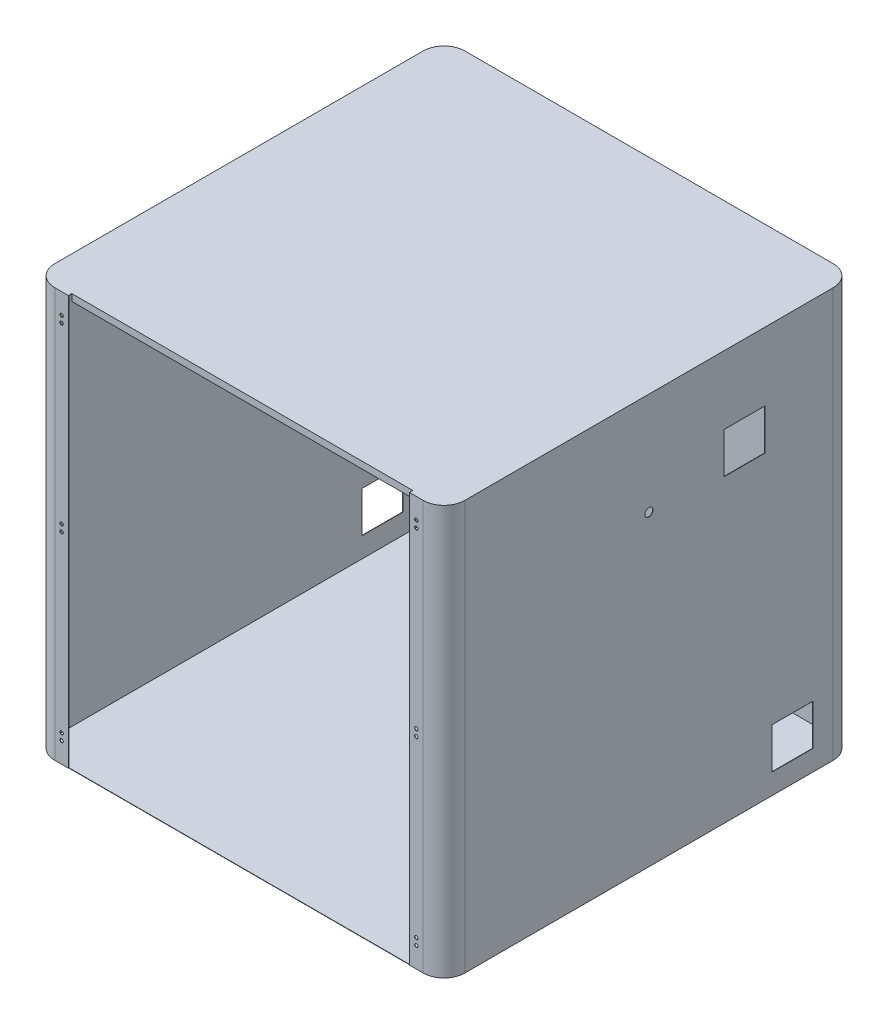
ISO-10303-21;
HEADER;
FILE_DESCRIPTION(('STEP AP214'),'2;1');
FILE_NAME('part.step','',(''),(''),'','','');
FILE_SCHEMA(('AUTOMOTIVE_DESIGN { 1 0 10303 214 1 1 1 1 }'));
ENDSEC;
DATA;
#1=APPLICATION_CONTEXT('core data for automotive mechanical design processes');
#2=APPLICATION_PROTOCOL_DEFINITION('international standard','automotive_design',2000,#1);
#3=PRODUCT_CONTEXT('',#1,'mechanical');
#4=PRODUCT('Part','Part','',(#3));
#5=PRODUCT_RELATED_PRODUCT_CATEGORY('part','',(#4));
#6=PRODUCT_DEFINITION_FORMATION('','',#4);
#7=PRODUCT_DEFINITION_CONTEXT('part definition',#1,'design');
#8=PRODUCT_DEFINITION('design','',#6,#7);
#9=PRODUCT_DEFINITION_SHAPE('','',#8);
#10=(LENGTH_UNIT() NAMED_UNIT(*) SI_UNIT(.MILLI.,.METRE.));
#11=(NAMED_UNIT(*) PLANE_ANGLE_UNIT() SI_UNIT($,.RADIAN.));
#12=(NAMED_UNIT(*) SI_UNIT($,.STERADIAN.) SOLID_ANGLE_UNIT());
#13=UNCERTAINTY_MEASURE_WITH_UNIT(LENGTH_MEASURE(1.E-05),#10,'distance_accuracy_value','');
#14=(GEOMETRIC_REPRESENTATION_CONTEXT(3) GLOBAL_UNCERTAINTY_ASSIGNED_CONTEXT((#13)) GLOBAL_UNIT_ASSIGNED_CONTEXT((#10,
#11,#12)) REPRESENTATION_CONTEXT('',''));
#15=CARTESIAN_POINT('',(0.,0.,0.));
#16=DIRECTION('',(0.,0.,1.));
#17=DIRECTION('',(1.,0.,0.));
#18=AXIS2_PLACEMENT_3D('',#15,#16,#17);
#19=CARTESIAN_POINT('',(-270.,600.,300.));
#20=DIRECTION('',(0.,0.,-1.));
#21=DIRECTION('',(-1.,0.,0.));
#22=AXIS2_PLACEMENT_3D('',#19,#20,#21);
#23=PLANE('',#22);
#24=CARTESIAN_POINT('',(260.,560.,300.));
#25=DIRECTION('',(0.,0.,1.));
#26=DIRECTION('',(1.,0.,0.));
#27=AXIS2_PLACEMENT_3D('',#24,#25,#26);
#28=CIRCLE('',#27,2.50000000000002);
#29=CARTESIAN_POINT('',(262.5,560.,300.));
#30=VERTEX_POINT('',#29);
#31=EDGE_CURVE('E739',#30,#30,#28,.T.);
#32=ORIENTED_EDGE('',*,*,#31,.T.);
#33=EDGE_LOOP('',(#32));
#34=FACE_BOUND('',#33,.T.);
#35=CARTESIAN_POINT('',(260.,570.,300.));
#36=DIRECTION('',(0.,0.,1.));
#37=DIRECTION('',(1.,0.,0.));
#38=AXIS2_PLACEMENT_3D('',#35,#36,#37);
#39=CIRCLE('',#38,2.50000000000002);
#40=CARTESIAN_POINT('',(262.5,570.,300.));
#41=VERTEX_POINT('',#40);
#42=EDGE_CURVE('E740',#41,#41,#39,.T.);
#43=ORIENTED_EDGE('',*,*,#42,.T.);
#44=EDGE_LOOP('',(#43));
#45=FACE_BOUND('',#44,.T.);
#46=CARTESIAN_POINT('',(260.,305.,300.));
#47=DIRECTION('',(0.,0.,1.));
#48=DIRECTION('',(1.,0.,0.));
#49=AXIS2_PLACEMENT_3D('',#46,#47,#48);
#50=CIRCLE('',#49,2.50000000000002);
#51=CARTESIAN_POINT('',(262.5,305.,300.));
#52=VERTEX_POINT('',#51);
#53=EDGE_CURVE('E749',#52,#52,#50,.T.);
#54=ORIENTED_EDGE('',*,*,#53,.T.);
#55=EDGE_LOOP('',(#54));
#56=FACE_BOUND('',#55,.T.);
#57=CARTESIAN_POINT('',(260.,295.,300.));
#58=DIRECTION('',(0.,0.,1.));
#59=DIRECTION('',(1.,0.,0.));
#60=AXIS2_PLACEMENT_3D('',#57,#58,#59);
#61=CIRCLE('',#60,2.50000000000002);
#62=CARTESIAN_POINT('',(262.5,295.,300.));
#63=VERTEX_POINT('',#62);
#64=EDGE_CURVE('E750',#63,#63,#61,.T.);
#65=ORIENTED_EDGE('',*,*,#64,.T.);
#66=EDGE_LOOP('',(#65));
#67=FACE_BOUND('',#66,.T.);
#68=CARTESIAN_POINT('',(260.,40.,300.));
#69=DIRECTION('',(0.,0.,1.));
#70=DIRECTION('',(-1.,0.,0.));
#71=AXIS2_PLACEMENT_3D('',#68,#69,#70);
#72=CIRCLE('',#71,2.50000000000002);
#73=CARTESIAN_POINT('',(257.5,40.,300.));
#74=VERTEX_POINT('',#73);
#75=EDGE_CURVE('E768',#74,#74,#72,.T.);
#76=ORIENTED_EDGE('',*,*,#75,.T.);
#77=EDGE_LOOP('',(#76));
#78=FACE_BOUND('',#77,.T.);
#79=CARTESIAN_POINT('',(260.,30.,300.));
#80=DIRECTION('',(0.,0.,1.));
#81=DIRECTION('',(-1.,0.,0.));
#82=AXIS2_PLACEMENT_3D('',#79,#80,#81);
#83=CIRCLE('',#82,2.50000000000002);
#84=CARTESIAN_POINT('',(257.5,30.,300.));
#85=VERTEX_POINT('',#84);
#86=EDGE_CURVE('E761',#85,#85,#83,.T.);
#87=ORIENTED_EDGE('',*,*,#86,.T.);
#88=EDGE_LOOP('',(#87));
#89=FACE_BOUND('',#88,.T.);
#90=DIRECTION('',(0.,-1.,0.));
#91=VECTOR('',#90,1.);
#92=CARTESIAN_POINT('',(270.,600.,300.));
#93=LINE('',#92,#91);
#94=CARTESIAN_POINT('',(270.,599.5,300.));
#95=VERTEX_POINT('',#94);
#96=CARTESIAN_POINT('',(270.,0.5,300.));
#97=VERTEX_POINT('',#96);
#98=EDGE_CURVE('E538',#95,#97,#93,.T.);
#99=ORIENTED_EDGE('',*,*,#98,.T.);
#100=DIRECTION('',(1.,0.,0.));
#101=VECTOR('',#100,1.);
#102=CARTESIAN_POINT('',(-270.,0.5,300.));
#103=LINE('',#102,#101);
#104=CARTESIAN_POINT('',(250.,0.5,300.));
#105=VERTEX_POINT('',#104);
#106=EDGE_CURVE('E463',#105,#97,#103,.T.);
#107=ORIENTED_EDGE('',*,*,#106,.F.);
#108=DIRECTION('',(0.,-1.,0.));
#109=VECTOR('',#108,1.);
#110=CARTESIAN_POINT('',(250.,600.,300.));
#111=LINE('',#110,#109);
#112=CARTESIAN_POINT('',(250.,599.5,300.));
#113=VERTEX_POINT('',#112);
#114=EDGE_CURVE('E613',#113,#105,#111,.T.);
#115=ORIENTED_EDGE('',*,*,#114,.F.);
#116=DIRECTION('',(1.,0.,0.));
#117=VECTOR('',#116,1.);
#118=CARTESIAN_POINT('',(-270.,599.5,300.));
#119=LINE('',#118,#117);
#120=EDGE_CURVE('E502',#113,#95,#119,.T.);
#121=ORIENTED_EDGE('',*,*,#120,.T.);
#122=EDGE_LOOP('',(#99,#107,#115,#121));
#123=FACE_BOUND('',#122,.T.);
#124=ADVANCED_FACE('F86',(#34,#45,#56,#67,#78,#89,#123),#23,.T.);
#125=CARTESIAN_POINT('',(-270.,600.,270.));
#126=DIRECTION('',(0.,-1.,0.));
#127=DIRECTION('',(0.,0.,-1.));
#128=AXIS2_PLACEMENT_3D('',#125,#126,#127);
#129=CYLINDRICAL_SURFACE('',#128,30.);
#130=DIRECTION('',(0.,-1.,0.));
#131=VECTOR('',#130,1.);
#132=CARTESIAN_POINT('',(-270.,600.,300.));
#133=LINE('',#132,#131);
#134=CARTESIAN_POINT('',(-270.,599.5,300.));
#135=VERTEX_POINT('',#134);
#136=CARTESIAN_POINT('',(-270.,0.5,300.));
#137=VERTEX_POINT('',#136);
#138=EDGE_CURVE('E541',#135,#137,#133,.T.);
#139=ORIENTED_EDGE('',*,*,#138,.T.);
#140=CARTESIAN_POINT('',(-270.,0.5,270.));
#141=DIRECTION('',(0.,1.,0.));
#142=DIRECTION('',(0.,0.,1.));
#143=AXIS2_PLACEMENT_3D('',#140,#141,#142);
#144=CIRCLE('',#143,30.);
#145=CARTESIAN_POINT('',(-300.,0.5,270.));
#146=VERTEX_POINT('',#145);
#147=EDGE_CURVE('E467',#146,#137,#144,.T.);
#148=ORIENTED_EDGE('',*,*,#147,.F.);
#149=DIRECTION('',(0.,-1.,0.));
#150=VECTOR('',#149,1.);
#151=CARTESIAN_POINT('',(-300.,600.,270.));
#152=LINE('',#151,#150);
#153=CARTESIAN_POINT('',(-300.,599.5,270.));
#154=VERTEX_POINT('',#153);
#155=EDGE_CURVE('E513',#154,#146,#152,.T.);
#156=ORIENTED_EDGE('',*,*,#155,.F.);
#157=CARTESIAN_POINT('',(-270.,599.5,270.));
#158=DIRECTION('',(0.,1.,0.));
#159=DIRECTION('',(0.,0.,1.));
#160=AXIS2_PLACEMENT_3D('',#157,#158,#159);
#161=CIRCLE('',#160,30.);
#162=EDGE_CURVE('E499',#154,#135,#161,.T.);
#163=ORIENTED_EDGE('',*,*,#162,.T.);
#164=EDGE_LOOP('',(#139,#148,#156,#163));
#165=FACE_BOUND('',#164,.T.);
#166=ADVANCED_FACE('F626',(#165),#129,.F.);
#167=CARTESIAN_POINT('',(-260.,560.,300.));
#168=DIRECTION('',(0.,0.,1.));
#169=DIRECTION('',(-1.,0.,0.));
#170=AXIS2_PLACEMENT_3D('',#167,#168,#169);
#171=CIRCLE('',#170,2.50000000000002);
#172=CARTESIAN_POINT('',(-262.5,560.,300.));
#173=VERTEX_POINT('',#172);
#174=EDGE_CURVE('E696',#173,#173,#171,.T.);
#175=ORIENTED_EDGE('',*,*,#174,.T.);
#176=EDGE_LOOP('',(#175));
#177=FACE_BOUND('',#176,.T.);
#178=CARTESIAN_POINT('',(-260.,570.,300.));
#179=DIRECTION('',(0.,0.,1.));
#180=DIRECTION('',(-1.,0.,0.));
#181=AXIS2_PLACEMENT_3D('',#178,#179,#180);
#182=CIRCLE('',#181,2.50000000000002);
#183=CARTESIAN_POINT('',(-262.5,570.,300.));
#184=VERTEX_POINT('',#183);
#185=EDGE_CURVE('E700',#184,#184,#182,.T.);
#186=ORIENTED_EDGE('',*,*,#185,.T.);
#187=EDGE_LOOP('',(#186));
#188=FACE_BOUND('',#187,.T.);
#189=CARTESIAN_POINT('',(-260.,305.,300.));
#190=DIRECTION('',(0.,0.,1.));
#191=DIRECTION('',(-1.,0.,0.));
#192=AXIS2_PLACEMENT_3D('',#189,#190,#191);
#193=CIRCLE('',#192,2.50000000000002);
#194=CARTESIAN_POINT('',(-262.5,305.,300.));
#195=VERTEX_POINT('',#194);
#196=EDGE_CURVE('E704',#195,#195,#193,.T.);
#197=ORIENTED_EDGE('',*,*,#196,.T.);
#198=EDGE_LOOP('',(#197));
#199=FACE_BOUND('',#198,.T.);
#200=CARTESIAN_POINT('',(-260.,295.,300.));
#201=DIRECTION('',(0.,0.,1.));
#202=DIRECTION('',(-1.,0.,0.));
#203=AXIS2_PLACEMENT_3D('',#200,#201,#202);
#204=CIRCLE('',#203,2.50000000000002);
#205=CARTESIAN_POINT('',(-262.5,295.,300.));
#206=VERTEX_POINT('',#205);
#207=EDGE_CURVE('E708',#206,#206,#204,.T.);
#208=ORIENTED_EDGE('',*,*,#207,.T.);
#209=EDGE_LOOP('',(#208));
#210=FACE_BOUND('',#209,.T.);
#211=CARTESIAN_POINT('',(-260.,40.,300.));
#212=DIRECTION('',(0.,0.,1.));
#213=DIRECTION('',(1.,0.,0.));
#214=AXIS2_PLACEMENT_3D('',#211,#212,#213);
#215=CIRCLE('',#214,2.50000000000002);
#216=CARTESIAN_POINT('',(-257.5,40.,300.));
#217=VERTEX_POINT('',#216);
#218=EDGE_CURVE('E712',#217,#217,#215,.T.);
#219=ORIENTED_EDGE('',*,*,#218,.T.);
#220=EDGE_LOOP('',(#219));
#221=FACE_BOUND('',#220,.T.);
#222=CARTESIAN_POINT('',(-260.,30.,300.));
#223=DIRECTION('',(0.,0.,1.));
#224=DIRECTION('',(1.,0.,0.));
#225=AXIS2_PLACEMENT_3D('',#222,#223,#224);
#226=CIRCLE('',#225,2.50000000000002);
#227=CARTESIAN_POINT('',(-257.5,30.,300.));
#228=VERTEX_POINT('',#227);
#229=EDGE_CURVE('E358',#228,#228,#226,.T.);
#230=ORIENTED_EDGE('',*,*,#229,.T.);
#231=EDGE_LOOP('',(#230));
#232=FACE_BOUND('',#231,.T.);
#233=DIRECTION('',(0.,1.,0.));
#234=VECTOR('',#233,1.);
#235=CARTESIAN_POINT('',(-250.,600.,300.));
#236=LINE('',#235,#234);
#237=CARTESIAN_POINT('',(-250.,0.5,300.));
#238=VERTEX_POINT('',#237);
#239=CARTESIAN_POINT('',(-250.,599.5,300.));
#240=VERTEX_POINT('',#239);
#241=EDGE_CURVE('E606',#238,#240,#236,.T.);
#242=ORIENTED_EDGE('',*,*,#241,.F.);
#243=EDGE_CURVE('E464',#137,#238,#103,.T.);
#244=ORIENTED_EDGE('',*,*,#243,.F.);
#245=ORIENTED_EDGE('',*,*,#138,.F.);
#246=EDGE_CURVE('E503',#135,#240,#119,.T.);
#247=ORIENTED_EDGE('',*,*,#246,.T.);
#248=EDGE_LOOP('',(#242,#244,#245,#247));
#249=FACE_BOUND('',#248,.T.);
#250=ADVANCED_FACE('F622',(#177,#188,#199,#210,#221,#232,#249),#23,.T.);
#251=CARTESIAN_POINT('',(270.,600.,270.));
#252=DIRECTION('',(0.,-1.,0.));
#253=DIRECTION('',(0.,0.,-1.));
#254=AXIS2_PLACEMENT_3D('',#251,#252,#253);
#255=CYLINDRICAL_SURFACE('',#254,30.);
#256=DIRECTION('',(0.,-1.,0.));
#257=VECTOR('',#256,1.);
#258=CARTESIAN_POINT('',(300.,600.,270.));
#259=LINE('',#258,#257);
#260=CARTESIAN_POINT('',(300.,599.5,270.));
#261=VERTEX_POINT('',#260);
#262=CARTESIAN_POINT('',(300.,0.5,270.));
#263=VERTEX_POINT('',#262);
#264=EDGE_CURVE('E535',#261,#263,#259,.T.);
#265=ORIENTED_EDGE('',*,*,#264,.T.);
#266=CARTESIAN_POINT('',(270.,0.5,270.));
#267=DIRECTION('',(0.,1.,0.));
#268=DIRECTION('',(0.,0.,1.));
#269=AXIS2_PLACEMENT_3D('',#266,#267,#268);
#270=CIRCLE('',#269,30.);
#271=EDGE_CURVE('E461',#97,#263,#270,.T.);
#272=ORIENTED_EDGE('',*,*,#271,.F.);
#273=ORIENTED_EDGE('',*,*,#98,.F.);
#274=CARTESIAN_POINT('',(270.,599.5,270.));
#275=DIRECTION('',(0.,1.,0.));
#276=DIRECTION('',(0.,0.,1.));
#277=AXIS2_PLACEMENT_3D('',#274,#275,#276);
#278=CIRCLE('',#277,30.);
#279=EDGE_CURVE('E480',#95,#261,#278,.T.);
#280=ORIENTED_EDGE('',*,*,#279,.T.);
#281=EDGE_LOOP('',(#265,#272,#273,#280));
#282=FACE_BOUND('',#281,.T.);
#283=ADVANCED_FACE('F650',(#282),#255,.F.);
#284=CARTESIAN_POINT('',(300.,600.,270.));
#285=DIRECTION('',(-1.,0.,0.));
#286=DIRECTION('',(0.,0.,1.));
#287=AXIS2_PLACEMENT_3D('',#284,#285,#286);
#288=PLANE('',#287);
#289=CARTESIAN_POINT('',(300.,450.,0.));
#290=DIRECTION('',(-1.,0.,0.));
#291=DIRECTION('',(0.,0.,1.));
#292=AXIS2_PLACEMENT_3D('',#289,#290,#291);
#293=CIRCLE('',#292,6.);
#294=CARTESIAN_POINT('',(300.,450.,6.));
#295=VERTEX_POINT('',#294);
#296=EDGE_CURVE('E762',#295,#295,#293,.T.);
#297=ORIENTED_EDGE('',*,*,#296,.F.);
#298=EDGE_LOOP('',(#297));
#299=FACE_BOUND('',#298,.T.);
#300=DIRECTION('',(0.,1.,0.));
#301=VECTOR('',#300,1.);
#302=CARTESIAN_POINT('',(300.,600.,-180.));
#303=LINE('',#302,#301);
#304=CARTESIAN_POINT('',(300.,30.,-180.));
#305=VERTEX_POINT('',#304);
#306=CARTESIAN_POINT('',(300.,90.,-180.));
#307=VERTEX_POINT('',#306);
#308=EDGE_CURVE('E425',#305,#307,#303,.T.);
#309=ORIENTED_EDGE('',*,*,#308,.F.);
#310=DIRECTION('',(0.,0.,1.));
#311=VECTOR('',#310,1.);
#312=CARTESIAN_POINT('',(300.,30.,270.));
#313=LINE('',#312,#311);
#314=CARTESIAN_POINT('',(300.,30.,-240.));
#315=VERTEX_POINT('',#314);
#316=EDGE_CURVE('E418',#315,#305,#313,.T.);
#317=ORIENTED_EDGE('',*,*,#316,.F.);
#318=DIRECTION('',(0.,-1.,0.));
#319=VECTOR('',#318,1.);
#320=CARTESIAN_POINT('',(300.,600.,-240.));
#321=LINE('',#320,#319);
#322=CARTESIAN_POINT('',(300.,90.,-240.));
#323=VERTEX_POINT('',#322);
#324=EDGE_CURVE('E411',#323,#315,#321,.T.);
#325=ORIENTED_EDGE('',*,*,#324,.F.);
#326=DIRECTION('',(0.,0.,-1.));
#327=VECTOR('',#326,1.);
#328=CARTESIAN_POINT('',(300.,90.,270.));
#329=LINE('',#328,#327);
#330=EDGE_CURVE('E403',#307,#323,#329,.T.);
#331=ORIENTED_EDGE('',*,*,#330,.F.);
#332=EDGE_LOOP('',(#309,#317,#325,#331));
#333=FACE_BOUND('',#332,.T.);
#334=DIRECTION('',(0.,1.,0.));
#335=VECTOR('',#334,1.);
#336=CARTESIAN_POINT('',(300.,440.,-170.));
#337=LINE('',#336,#335);
#338=CARTESIAN_POINT('',(300.,440.,-170.));
#339=VERTEX_POINT('',#338);
#340=CARTESIAN_POINT('',(300.,500.,-170.));
#341=VERTEX_POINT('',#340);
#342=EDGE_CURVE('E429',#339,#341,#337,.T.);
#343=ORIENTED_EDGE('',*,*,#342,.T.);
#344=DIRECTION('',(0.,0.,1.));
#345=VECTOR('',#344,1.);
#346=CARTESIAN_POINT('',(300.,500.,-110.));
#347=LINE('',#346,#345);
#348=CARTESIAN_POINT('',(300.,500.,-110.));
#349=VERTEX_POINT('',#348);
#350=EDGE_CURVE('E432',#341,#349,#347,.T.);
#351=ORIENTED_EDGE('',*,*,#350,.T.);
#352=DIRECTION('',(0.,-1.,0.));
#353=VECTOR('',#352,1.);
#354=CARTESIAN_POINT('',(300.,440.,-110.));
#355=LINE('',#354,#353);
#356=CARTESIAN_POINT('',(300.,440.,-110.));
#357=VERTEX_POINT('',#356);
#358=EDGE_CURVE('E436',#349,#357,#355,.T.);
#359=ORIENTED_EDGE('',*,*,#358,.T.);
#360=DIRECTION('',(0.,0.,-1.));
#361=VECTOR('',#360,1.);
#362=CARTESIAN_POINT('',(300.,440.,-110.));
#363=LINE('',#362,#361);
#364=EDGE_CURVE('E439',#357,#339,#363,.T.);
#365=ORIENTED_EDGE('',*,*,#364,.T.);
#366=EDGE_LOOP('',(#343,#351,#359,#365));
#367=FACE_BOUND('',#366,.T.);
#368=DIRECTION('',(0.,-1.,0.));
#369=VECTOR('',#368,1.);
#370=CARTESIAN_POINT('',(300.,600.,-270.));
#371=LINE('',#370,#369);
#372=CARTESIAN_POINT('',(300.,599.5,-270.));
#373=VERTEX_POINT('',#372);
#374=CARTESIAN_POINT('',(300.,0.5,-270.));
#375=VERTEX_POINT('',#374);
#376=EDGE_CURVE('E532',#373,#375,#371,.T.);
#377=ORIENTED_EDGE('',*,*,#376,.T.);
#378=DIRECTION('',(0.,0.,-1.));
#379=VECTOR('',#378,1.);
#380=CARTESIAN_POINT('',(300.,0.5,270.));
#381=LINE('',#380,#379);
#382=EDGE_CURVE('E478',#263,#375,#381,.T.);
#383=ORIENTED_EDGE('',*,*,#382,.F.);
#384=ORIENTED_EDGE('',*,*,#264,.F.);
#385=DIRECTION('',(0.,0.,-1.));
#386=VECTOR('',#385,1.);
#387=CARTESIAN_POINT('',(300.,599.5,270.));
#388=LINE('',#387,#386);
#389=EDGE_CURVE('E484',#261,#373,#388,.T.);
#390=ORIENTED_EDGE('',*,*,#389,.T.);
#391=EDGE_LOOP('',(#377,#383,#384,#390));
#392=FACE_BOUND('',#391,.T.);
#393=ADVANCED_FACE('F646',(#299,#333,#367,#392),#288,.T.);
#394=CARTESIAN_POINT('',(270.,600.,-270.));
#395=DIRECTION('',(0.,-1.,0.));
#396=DIRECTION('',(0.,0.,-1.));
#397=AXIS2_PLACEMENT_3D('',#394,#395,#396);
#398=CYLINDRICAL_SURFACE('',#397,30.);
#399=DIRECTION('',(0.,-1.,0.));
#400=VECTOR('',#399,1.);
#401=CARTESIAN_POINT('',(270.,600.,-300.));
#402=LINE('',#401,#400);
#403=CARTESIAN_POINT('',(270.,599.5,-300.));
#404=VERTEX_POINT('',#403);
#405=CARTESIAN_POINT('',(270.,0.5,-300.));
#406=VERTEX_POINT('',#405);
#407=EDGE_CURVE('E529',#404,#406,#402,.T.);
#408=ORIENTED_EDGE('',*,*,#407,.T.);
#409=CARTESIAN_POINT('',(270.,0.5,-270.));
#410=DIRECTION('',(0.,1.,0.));
#411=DIRECTION('',(0.,0.,1.));
#412=AXIS2_PLACEMENT_3D('',#409,#410,#411);
#413=CIRCLE('',#412,30.);
#414=EDGE_CURVE('E476',#375,#406,#413,.T.);
#415=ORIENTED_EDGE('',*,*,#414,.F.);
#416=ORIENTED_EDGE('',*,*,#376,.F.);
#417=CARTESIAN_POINT('',(270.,599.5,-270.));
#418=DIRECTION('',(0.,1.,0.));
#419=DIRECTION('',(0.,0.,1.));
#420=AXIS2_PLACEMENT_3D('',#417,#418,#419);
#421=CIRCLE('',#420,30.);
#422=EDGE_CURVE('E487',#373,#404,#421,.T.);
#423=ORIENTED_EDGE('',*,*,#422,.T.);
#424=EDGE_LOOP('',(#408,#415,#416,#423));
#425=FACE_BOUND('',#424,.T.);
#426=ADVANCED_FACE('F642',(#425),#398,.F.);
#427=CARTESIAN_POINT('',(-270.,600.,-300.));
#428=DIRECTION('',(0.,0.,1.));
#429=DIRECTION('',(1.,0.,0.));
#430=AXIS2_PLACEMENT_3D('',#427,#428,#429);
#431=PLANE('',#430);
#432=DIRECTION('',(0.,-1.,0.));
#433=VECTOR('',#432,1.);
#434=CARTESIAN_POINT('',(-270.,600.,-300.));
#435=LINE('',#434,#433);
#436=CARTESIAN_POINT('',(-270.,599.5,-300.));
#437=VERTEX_POINT('',#436);
#438=CARTESIAN_POINT('',(-270.,0.5,-300.));
#439=VERTEX_POINT('',#438);
#440=EDGE_CURVE('E526',#437,#439,#435,.T.);
#441=ORIENTED_EDGE('',*,*,#440,.T.);
#442=DIRECTION('',(-1.,0.,0.));
#443=VECTOR('',#442,1.);
#444=CARTESIAN_POINT('',(270.,0.5,-300.));
#445=LINE('',#444,#443);
#446=EDGE_CURVE('E474',#406,#439,#445,.T.);
#447=ORIENTED_EDGE('',*,*,#446,.F.);
#448=ORIENTED_EDGE('',*,*,#407,.F.);
#449=DIRECTION('',(-1.,0.,0.));
#450=VECTOR('',#449,1.);
#451=CARTESIAN_POINT('',(270.,599.5,-300.));
#452=LINE('',#451,#450);
#453=EDGE_CURVE('E490',#404,#437,#452,.T.);
#454=ORIENTED_EDGE('',*,*,#453,.T.);
#455=EDGE_LOOP('',(#441,#447,#448,#454));
#456=FACE_BOUND('',#455,.T.);
#457=ADVANCED_FACE('F638',(#456),#431,.T.);
#458=CARTESIAN_POINT('',(-270.,600.,-270.));
#459=DIRECTION('',(0.,-1.,0.));
#460=DIRECTION('',(0.,0.,-1.));
#461=AXIS2_PLACEMENT_3D('',#458,#459,#460);
#462=CYLINDRICAL_SURFACE('',#461,30.);
#463=DIRECTION('',(0.,-1.,0.));
#464=VECTOR('',#463,1.);
#465=CARTESIAN_POINT('',(-300.,600.,-270.));
#466=LINE('',#465,#464);
#467=CARTESIAN_POINT('',(-300.,599.5,-270.));
#468=VERTEX_POINT('',#467);
#469=CARTESIAN_POINT('',(-300.,0.5,-270.));
#470=VERTEX_POINT('',#469);
#471=EDGE_CURVE('E523',#468,#470,#466,.T.);
#472=ORIENTED_EDGE('',*,*,#471,.T.);
#473=CARTESIAN_POINT('',(-270.,0.5,-270.));
#474=DIRECTION('',(0.,1.,0.));
#475=DIRECTION('',(0.,0.,1.));
#476=AXIS2_PLACEMENT_3D('',#473,#474,#475);
#477=CIRCLE('',#476,30.);
#478=EDGE_CURVE('E472',#439,#470,#477,.T.);
#479=ORIENTED_EDGE('',*,*,#478,.F.);
#480=ORIENTED_EDGE('',*,*,#440,.F.);
#481=CARTESIAN_POINT('',(-270.,599.5,-270.));
#482=DIRECTION('',(0.,1.,0.));
#483=DIRECTION('',(0.,0.,1.));
#484=AXIS2_PLACEMENT_3D('',#481,#482,#483);
#485=CIRCLE('',#484,30.);
#486=EDGE_CURVE('E493',#437,#468,#485,.T.);
#487=ORIENTED_EDGE('',*,*,#486,.T.);
#488=EDGE_LOOP('',(#472,#479,#480,#487));
#489=FACE_BOUND('',#488,.T.);
#490=ADVANCED_FACE('F634',(#489),#462,.F.);
#491=CARTESIAN_POINT('',(-300.,600.,270.));
#492=DIRECTION('',(1.,0.,0.));
#493=DIRECTION('',(0.,0.,-1.));
#494=AXIS2_PLACEMENT_3D('',#491,#492,#493);
#495=PLANE('',#494);
#496=DIRECTION('',(0.,-1.,0.));
#497=VECTOR('',#496,1.);
#498=CARTESIAN_POINT('',(-300.,600.,-180.));
#499=LINE('',#498,#497);
#500=CARTESIAN_POINT('',(-300.,90.,-180.));
#501=VERTEX_POINT('',#500);
#502=CARTESIAN_POINT('',(-300.,30.,-180.));
#503=VERTEX_POINT('',#502);
#504=EDGE_CURVE('E423',#501,#503,#499,.T.);
#505=ORIENTED_EDGE('',*,*,#504,.F.);
#506=DIRECTION('',(0.,0.,1.));
#507=VECTOR('',#506,1.);
#508=CARTESIAN_POINT('',(-300.,90.,270.));
#509=LINE('',#508,#507);
#510=CARTESIAN_POINT('',(-300.,90.,-240.));
#511=VERTEX_POINT('',#510);
#512=EDGE_CURVE('E401',#511,#501,#509,.T.);
#513=ORIENTED_EDGE('',*,*,#512,.F.);
#514=DIRECTION('',(0.,1.,0.));
#515=VECTOR('',#514,1.);
#516=CARTESIAN_POINT('',(-300.,600.,-240.));
#517=LINE('',#516,#515);
#518=CARTESIAN_POINT('',(-300.,30.,-240.));
#519=VERTEX_POINT('',#518);
#520=EDGE_CURVE('E408',#519,#511,#517,.T.);
#521=ORIENTED_EDGE('',*,*,#520,.F.);
#522=DIRECTION('',(0.,0.,-1.));
#523=VECTOR('',#522,1.);
#524=CARTESIAN_POINT('',(-300.,30.,270.));
#525=LINE('',#524,#523);
#526=EDGE_CURVE('E416',#503,#519,#525,.T.);
#527=ORIENTED_EDGE('',*,*,#526,.F.);
#528=EDGE_LOOP('',(#505,#513,#521,#527));
#529=FACE_BOUND('',#528,.T.);
#530=ORIENTED_EDGE('',*,*,#155,.T.);
#531=DIRECTION('',(0.,0.,1.));
#532=VECTOR('',#531,1.);
#533=CARTESIAN_POINT('',(-300.,0.5,-270.));
#534=LINE('',#533,#532);
#535=EDGE_CURVE('E470',#470,#146,#534,.T.);
#536=ORIENTED_EDGE('',*,*,#535,.F.);
#537=ORIENTED_EDGE('',*,*,#471,.F.);
#538=DIRECTION('',(0.,0.,1.));
#539=VECTOR('',#538,1.);
#540=CARTESIAN_POINT('',(-300.,599.5,-270.));
#541=LINE('',#540,#539);
#542=EDGE_CURVE('E496',#468,#154,#541,.T.);
#543=ORIENTED_EDGE('',*,*,#542,.T.);
#544=EDGE_LOOP('',(#530,#536,#537,#543));
#545=FACE_BOUND('',#544,.T.);
#546=ADVANCED_FACE('F630',(#529,#545),#495,.T.);
#547=CARTESIAN_POINT('',(-270.,600.,300.5));
#548=DIRECTION('',(0.,0.,-1.));
#549=DIRECTION('',(-1.,0.,0.));
#550=AXIS2_PLACEMENT_3D('',#547,#548,#549);
#551=PLANE('',#550);
#552=CARTESIAN_POINT('',(260.,560.,300.5));
#553=DIRECTION('',(0.,0.,1.));
#554=DIRECTION('',(1.,0.,0.));
#555=AXIS2_PLACEMENT_3D('',#552,#553,#554);
#556=CIRCLE('',#555,2.50000000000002);
#557=CARTESIAN_POINT('',(262.5,560.,300.5));
#558=VERTEX_POINT('',#557);
#559=EDGE_CURVE('E736',#558,#558,#556,.T.);
#560=ORIENTED_EDGE('',*,*,#559,.F.);
#561=EDGE_LOOP('',(#560));
#562=FACE_BOUND('',#561,.T.);
#563=CARTESIAN_POINT('',(260.,570.,300.5));
#564=DIRECTION('',(0.,0.,1.));
#565=DIRECTION('',(1.,0.,0.));
#566=AXIS2_PLACEMENT_3D('',#563,#564,#565);
#567=CIRCLE('',#566,2.50000000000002);
#568=CARTESIAN_POINT('',(262.5,570.,300.5));
#569=VERTEX_POINT('',#568);
#570=EDGE_CURVE('E753',#569,#569,#567,.T.);
#571=ORIENTED_EDGE('',*,*,#570,.F.);
#572=EDGE_LOOP('',(#571));
#573=FACE_BOUND('',#572,.T.);
#574=CARTESIAN_POINT('',(260.,305.,300.5));
#575=DIRECTION('',(0.,0.,1.));
#576=DIRECTION('',(1.,0.,0.));
#577=AXIS2_PLACEMENT_3D('',#574,#575,#576);
#578=CIRCLE('',#577,2.50000000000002);
#579=CARTESIAN_POINT('',(262.5,305.,300.5));
#580=VERTEX_POINT('',#579);
#581=EDGE_CURVE('E746',#580,#580,#578,.T.);
#582=ORIENTED_EDGE('',*,*,#581,.F.);
#583=EDGE_LOOP('',(#582));
#584=FACE_BOUND('',#583,.T.);
#585=CARTESIAN_POINT('',(260.,295.,300.5));
#586=DIRECTION('',(0.,0.,1.));
#587=DIRECTION('',(1.,0.,0.));
#588=AXIS2_PLACEMENT_3D('',#585,#586,#587);
#589=CIRCLE('',#588,2.50000000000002);
#590=CARTESIAN_POINT('',(262.5,295.,300.5));
#591=VERTEX_POINT('',#590);
#592=EDGE_CURVE('E771',#591,#591,#589,.T.);
#593=ORIENTED_EDGE('',*,*,#592,.F.);
#594=EDGE_LOOP('',(#593));
#595=FACE_BOUND('',#594,.T.);
#596=CARTESIAN_POINT('',(260.,40.,300.5));
#597=DIRECTION('',(0.,0.,1.));
#598=DIRECTION('',(-1.,0.,0.));
#599=AXIS2_PLACEMENT_3D('',#596,#597,#598);
#600=CIRCLE('',#599,2.50000000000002);
#601=CARTESIAN_POINT('',(257.5,40.,300.5));
#602=VERTEX_POINT('',#601);
#603=EDGE_CURVE('E765',#602,#602,#600,.T.);
#604=ORIENTED_EDGE('',*,*,#603,.F.);
#605=EDGE_LOOP('',(#604));
#606=FACE_BOUND('',#605,.T.);
#607=CARTESIAN_POINT('',(260.,30.,300.5));
#608=DIRECTION('',(0.,0.,1.));
#609=DIRECTION('',(-1.,0.,0.));
#610=AXIS2_PLACEMENT_3D('',#607,#608,#609);
#611=CIRCLE('',#610,2.50000000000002);
#612=CARTESIAN_POINT('',(257.5,30.,300.5));
#613=VERTEX_POINT('',#612);
#614=EDGE_CURVE('E758',#613,#613,#611,.T.);
#615=ORIENTED_EDGE('',*,*,#614,.F.);
#616=EDGE_LOOP('',(#615));
#617=FACE_BOUND('',#616,.T.);
#618=DIRECTION('',(1.,0.,0.));
#619=VECTOR('',#618,1.);
#620=CARTESIAN_POINT('',(-270.,600.,300.5));
#621=LINE('',#620,#619);
#622=CARTESIAN_POINT('',(250.,600.,300.5));
#623=VERTEX_POINT('',#622);
#624=CARTESIAN_POINT('',(270.,600.,300.5));
#625=VERTEX_POINT('',#624);
#626=EDGE_CURVE('E548',#623,#625,#621,.T.);
#627=ORIENTED_EDGE('',*,*,#626,.F.);
#628=DIRECTION('',(0.,1.,0.));
#629=VECTOR('',#628,1.);
#630=CARTESIAN_POINT('',(250.,0.,300.5));
#631=LINE('',#630,#629);
#632=CARTESIAN_POINT('',(250.,0.,300.5));
#633=VERTEX_POINT('',#632);
#634=EDGE_CURVE('E506',#633,#623,#631,.T.);
#635=ORIENTED_EDGE('',*,*,#634,.F.);
#636=DIRECTION('',(1.,0.,0.));
#637=VECTOR('',#636,1.);
#638=CARTESIAN_POINT('',(-270.,0.,300.5));
#639=LINE('',#638,#637);
#640=CARTESIAN_POINT('',(270.,0.,300.5));
#641=VERTEX_POINT('',#640);
#642=EDGE_CURVE('E568',#633,#641,#639,.T.);
#643=ORIENTED_EDGE('',*,*,#642,.T.);
#644=DIRECTION('',(0.,-1.,0.));
#645=VECTOR('',#644,1.);
#646=CARTESIAN_POINT('',(270.,600.,300.5));
#647=LINE('',#646,#645);
#648=EDGE_CURVE('E600',#625,#641,#647,.T.);
#649=ORIENTED_EDGE('',*,*,#648,.F.);
#650=EDGE_LOOP('',(#627,#635,#643,#649));
#651=FACE_BOUND('',#650,.T.);
#652=ADVANCED_FACE('F829',(#562,#573,#584,#595,#606,#617,#651),#551,.F.);
#653=CARTESIAN_POINT('',(-270.,600.,270.));
#654=DIRECTION('',(0.,-1.,0.));
#655=DIRECTION('',(0.,0.,-1.));
#656=AXIS2_PLACEMENT_3D('',#653,#654,#655);
#657=PLANE('',#656);
#658=DIRECTION('',(-1.,0.,0.));
#659=VECTOR('',#658,1.);
#660=CARTESIAN_POINT('',(-250.,600.,295.5));
#661=LINE('',#660,#659);
#662=CARTESIAN_POINT('',(250.,600.,295.5));
#663=VERTEX_POINT('',#662);
#664=CARTESIAN_POINT('',(-250.,600.,295.5));
#665=VERTEX_POINT('',#664);
#666=EDGE_CURVE('E365',#663,#665,#661,.T.);
#667=ORIENTED_EDGE('',*,*,#666,.F.);
#668=DIRECTION('',(0.,0.,1.));
#669=VECTOR('',#668,1.);
#670=CARTESIAN_POINT('',(250.,600.,290.5));
#671=LINE('',#670,#669);
#672=EDGE_CURVE('E510',#663,#623,#671,.T.);
#673=ORIENTED_EDGE('',*,*,#672,.T.);
#674=ORIENTED_EDGE('',*,*,#626,.T.);
#675=CARTESIAN_POINT('',(270.,600.,270.));
#676=DIRECTION('',(0.,-1.,0.));
#677=DIRECTION('',(-1.,0.,0.));
#678=AXIS2_PLACEMENT_3D('',#675,#676,#677);
#679=CIRCLE('',#678,30.5);
#680=CARTESIAN_POINT('',(300.5,600.,270.));
#681=VERTEX_POINT('',#680);
#682=EDGE_CURVE('E553',#625,#681,#679,.F.);
#683=ORIENTED_EDGE('',*,*,#682,.T.);
#684=DIRECTION('',(0.,0.,-1.));
#685=VECTOR('',#684,1.);
#686=CARTESIAN_POINT('',(300.5,600.,270.));
#687=LINE('',#686,#685);
#688=CARTESIAN_POINT('',(300.5,600.,-270.));
#689=VERTEX_POINT('',#688);
#690=EDGE_CURVE('E555',#681,#689,#687,.T.);
#691=ORIENTED_EDGE('',*,*,#690,.T.);
#692=CARTESIAN_POINT('',(270.,600.,-270.));
#693=DIRECTION('',(0.,-1.,0.));
#694=DIRECTION('',(-1.,0.,0.));
#695=AXIS2_PLACEMENT_3D('',#692,#693,#694);
#696=CIRCLE('',#695,30.5);
#697=CARTESIAN_POINT('',(270.,600.,-300.5));
#698=VERTEX_POINT('',#697);
#699=EDGE_CURVE('E557',#689,#698,#696,.F.);
#700=ORIENTED_EDGE('',*,*,#699,.T.);
#701=DIRECTION('',(-1.,0.,0.));
#702=VECTOR('',#701,1.);
#703=CARTESIAN_POINT('',(-270.,600.,-300.5));
#704=LINE('',#703,#702);
#705=CARTESIAN_POINT('',(-270.,600.,-300.5));
#706=VERTEX_POINT('',#705);
#707=EDGE_CURVE('E559',#698,#706,#704,.T.);
#708=ORIENTED_EDGE('',*,*,#707,.T.);
#709=CARTESIAN_POINT('',(-270.,600.,-270.));
#710=DIRECTION('',(0.,-1.,0.));
#711=DIRECTION('',(-1.,0.,0.));
#712=AXIS2_PLACEMENT_3D('',#709,#710,#711);
#713=CIRCLE('',#712,30.5);
#714=CARTESIAN_POINT('',(-300.5,600.,-270.));
#715=VERTEX_POINT('',#714);
#716=EDGE_CURVE('E561',#706,#715,#713,.F.);
#717=ORIENTED_EDGE('',*,*,#716,.T.);
#718=DIRECTION('',(0.,0.,1.));
#719=VECTOR('',#718,1.);
#720=CARTESIAN_POINT('',(-300.5,600.,270.));
#721=LINE('',#720,#719);
#722=CARTESIAN_POINT('',(-300.5,600.,270.));
#723=VERTEX_POINT('',#722);
#724=EDGE_CURVE('E563',#715,#723,#721,.T.);
#725=ORIENTED_EDGE('',*,*,#724,.T.);
#726=CARTESIAN_POINT('',(-270.,600.,270.));
#727=DIRECTION('',(0.,-1.,0.));
#728=DIRECTION('',(-1.,0.,0.));
#729=AXIS2_PLACEMENT_3D('',#726,#727,#728);
#730=CIRCLE('',#729,30.5);
#731=CARTESIAN_POINT('',(-270.,600.,300.5));
#732=VERTEX_POINT('',#731);
#733=EDGE_CURVE('E545',#723,#732,#730,.F.);
#734=ORIENTED_EDGE('',*,*,#733,.T.);
#735=CARTESIAN_POINT('',(-250.,600.,300.5));
#736=VERTEX_POINT('',#735);
#737=EDGE_CURVE('E550',#732,#736,#621,.T.);
#738=ORIENTED_EDGE('',*,*,#737,.T.);
#739=DIRECTION('',(0.,0.,1.));
#740=VECTOR('',#739,1.);
#741=CARTESIAN_POINT('',(-250.,600.,290.5));
#742=LINE('',#741,#740);
#743=EDGE_CURVE('E517',#665,#736,#742,.T.);
#744=ORIENTED_EDGE('',*,*,#743,.F.);
#745=EDGE_LOOP('',(#667,#673,#674,#683,#691,#700,#708,#717,#725,#734,#738,#744));
#746=FACE_BOUND('',#745,.T.);
#747=ADVANCED_FACE('F820',(#746),#657,.F.);
#748=CARTESIAN_POINT('',(-270.,0.,270.));
#749=DIRECTION('',(0.,-1.,0.));
#750=DIRECTION('',(0.,0.,-1.));
#751=AXIS2_PLACEMENT_3D('',#748,#749,#750);
#752=PLANE('',#751);
#753=DIRECTION('',(1.,0.,0.));
#754=VECTOR('',#753,1.);
#755=CARTESIAN_POINT('',(-270.,0.,300.));
#756=LINE('',#755,#754);
#757=CARTESIAN_POINT('',(-250.,0.,300.));
#758=VERTEX_POINT('',#757);
#759=CARTESIAN_POINT('',(250.,0.,300.));
#760=VERTEX_POINT('',#759);
#761=EDGE_CURVE('E454',#758,#760,#756,.T.);
#762=ORIENTED_EDGE('',*,*,#761,.F.);
#763=DIRECTION('',(0.,0.,1.));
#764=VECTOR('',#763,1.);
#765=CARTESIAN_POINT('',(-250.,0.,290.5));
#766=LINE('',#765,#764);
#767=CARTESIAN_POINT('',(-250.,0.,300.5));
#768=VERTEX_POINT('',#767);
#769=EDGE_CURVE('E514',#758,#768,#766,.T.);
#770=ORIENTED_EDGE('',*,*,#769,.T.);
#771=CARTESIAN_POINT('',(-270.,0.,300.5));
#772=VERTEX_POINT('',#771);
#773=EDGE_CURVE('E569',#772,#768,#639,.T.);
#774=ORIENTED_EDGE('',*,*,#773,.F.);
#775=CARTESIAN_POINT('',(-270.,0.,270.));
#776=DIRECTION('',(0.,-1.,0.));
#777=DIRECTION('',(-1.,0.,0.));
#778=AXIS2_PLACEMENT_3D('',#775,#776,#777);
#779=CIRCLE('',#778,30.5);
#780=CARTESIAN_POINT('',(-300.5,0.,270.));
#781=VERTEX_POINT('',#780);
#782=EDGE_CURVE('E544',#781,#772,#779,.F.);
#783=ORIENTED_EDGE('',*,*,#782,.F.);
#784=DIRECTION('',(0.,0.,1.));
#785=VECTOR('',#784,1.);
#786=CARTESIAN_POINT('',(-300.5,0.,270.));
#787=LINE('',#786,#785);
#788=CARTESIAN_POINT('',(-300.5,0.,-270.));
#789=VERTEX_POINT('',#788);
#790=EDGE_CURVE('E549',#789,#781,#787,.T.);
#791=ORIENTED_EDGE('',*,*,#790,.F.);
#792=CARTESIAN_POINT('',(-270.,0.,-270.));
#793=DIRECTION('',(0.,-1.,0.));
#794=DIRECTION('',(-1.,0.,0.));
#795=AXIS2_PLACEMENT_3D('',#792,#793,#794);
#796=CIRCLE('',#795,30.5);
#797=CARTESIAN_POINT('',(-270.,0.,-300.5));
#798=VERTEX_POINT('',#797);
#799=EDGE_CURVE('E580',#798,#789,#796,.F.);
#800=ORIENTED_EDGE('',*,*,#799,.F.);
#801=DIRECTION('',(-1.,0.,0.));
#802=VECTOR('',#801,1.);
#803=CARTESIAN_POINT('',(-270.,0.,-300.5));
#804=LINE('',#803,#802);
#805=CARTESIAN_POINT('',(270.,0.,-300.5));
#806=VERTEX_POINT('',#805);
#807=EDGE_CURVE('E578',#806,#798,#804,.T.);
#808=ORIENTED_EDGE('',*,*,#807,.F.);
#809=CARTESIAN_POINT('',(270.,0.,-270.));
#810=DIRECTION('',(0.,-1.,0.));
#811=DIRECTION('',(-1.,0.,0.));
#812=AXIS2_PLACEMENT_3D('',#809,#810,#811);
#813=CIRCLE('',#812,30.5);
#814=CARTESIAN_POINT('',(300.5,0.,-270.));
#815=VERTEX_POINT('',#814);
#816=EDGE_CURVE('E576',#815,#806,#813,.F.);
#817=ORIENTED_EDGE('',*,*,#816,.F.);
#818=DIRECTION('',(0.,0.,-1.));
#819=VECTOR('',#818,1.);
#820=CARTESIAN_POINT('',(300.5,0.,270.));
#821=LINE('',#820,#819);
#822=CARTESIAN_POINT('',(300.5,0.,270.));
#823=VERTEX_POINT('',#822);
#824=EDGE_CURVE('E574',#823,#815,#821,.T.);
#825=ORIENTED_EDGE('',*,*,#824,.F.);
#826=CARTESIAN_POINT('',(270.,0.,270.));
#827=DIRECTION('',(0.,-1.,0.));
#828=DIRECTION('',(-1.,0.,0.));
#829=AXIS2_PLACEMENT_3D('',#826,#827,#828);
#830=CIRCLE('',#829,30.5);
#831=EDGE_CURVE('E572',#641,#823,#830,.F.);
#832=ORIENTED_EDGE('',*,*,#831,.F.);
#833=ORIENTED_EDGE('',*,*,#642,.F.);
#834=DIRECTION('',(0.,0.,1.));
#835=VECTOR('',#834,1.);
#836=CARTESIAN_POINT('',(250.,0.,290.5));
#837=LINE('',#836,#835);
#838=EDGE_CURVE('E511',#760,#633,#837,.T.);
#839=ORIENTED_EDGE('',*,*,#838,.F.);
#840=EDGE_LOOP('',(#762,#770,#774,#783,#791,#800,#808,#817,#825,#832,#833,#839));
#841=FACE_BOUND('',#840,.T.);
#842=ADVANCED_FACE('F806',(#841),#752,.T.);
#843=CARTESIAN_POINT('',(-270.,600.,270.));
#844=DIRECTION('',(0.,-1.,0.));
#845=DIRECTION('',(0.,0.,-1.));
#846=AXIS2_PLACEMENT_3D('',#843,#844,#845);
#847=CYLINDRICAL_SURFACE('',#846,30.5);
#848=ORIENTED_EDGE('',*,*,#782,.T.);
#849=DIRECTION('',(0.,-1.,0.));
#850=VECTOR('',#849,1.);
#851=CARTESIAN_POINT('',(-270.,600.,300.5));
#852=LINE('',#851,#850);
#853=EDGE_CURVE('E603',#732,#772,#852,.T.);
#854=ORIENTED_EDGE('',*,*,#853,.F.);
#855=ORIENTED_EDGE('',*,*,#733,.F.);
#856=DIRECTION('',(0.,-1.,0.));
#857=VECTOR('',#856,1.);
#858=CARTESIAN_POINT('',(-300.5,600.,270.));
#859=LINE('',#858,#857);
#860=EDGE_CURVE('E565',#723,#781,#859,.T.);
#861=ORIENTED_EDGE('',*,*,#860,.T.);
#862=EDGE_LOOP('',(#848,#854,#855,#861));
#863=FACE_BOUND('',#862,.T.);
#864=ADVANCED_FACE('F88',(#863),#847,.T.);
#865=CARTESIAN_POINT('',(-260.,560.,300.5));
#866=DIRECTION('',(0.,0.,1.));
#867=DIRECTION('',(-1.,0.,0.));
#868=AXIS2_PLACEMENT_3D('',#865,#866,#867);
#869=CIRCLE('',#868,2.50000000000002);
#870=CARTESIAN_POINT('',(-262.5,560.,300.5));
#871=VERTEX_POINT('',#870);
#872=EDGE_CURVE('E742',#871,#871,#869,.T.);
#873=ORIENTED_EDGE('',*,*,#872,.F.);
#874=EDGE_LOOP('',(#873));
#875=FACE_BOUND('',#874,.T.);
#876=CARTESIAN_POINT('',(-260.,570.,300.5));
#877=DIRECTION('',(0.,0.,1.));
#878=DIRECTION('',(-1.,0.,0.));
#879=AXIS2_PLACEMENT_3D('',#876,#877,#878);
#880=CIRCLE('',#879,2.50000000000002);
#881=CARTESIAN_POINT('',(-262.5,570.,300.5));
#882=VERTEX_POINT('',#881);
#883=EDGE_CURVE('E720',#882,#882,#880,.T.);
#884=ORIENTED_EDGE('',*,*,#883,.F.);
#885=EDGE_LOOP('',(#884));
#886=FACE_BOUND('',#885,.T.);
#887=CARTESIAN_POINT('',(-260.,305.,300.5));
#888=DIRECTION('',(0.,0.,1.));
#889=DIRECTION('',(-1.,0.,0.));
#890=AXIS2_PLACEMENT_3D('',#887,#888,#889);
#891=CIRCLE('',#890,2.50000000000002);
#892=CARTESIAN_POINT('',(-262.5,305.,300.5));
#893=VERTEX_POINT('',#892);
#894=EDGE_CURVE('E724',#893,#893,#891,.T.);
#895=ORIENTED_EDGE('',*,*,#894,.F.);
#896=EDGE_LOOP('',(#895));
#897=FACE_BOUND('',#896,.T.);
#898=CARTESIAN_POINT('',(-260.,295.,300.5));
#899=DIRECTION('',(0.,0.,1.));
#900=DIRECTION('',(-1.,0.,0.));
#901=AXIS2_PLACEMENT_3D('',#898,#899,#900);
#902=CIRCLE('',#901,2.50000000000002);
#903=CARTESIAN_POINT('',(-262.5,295.,300.5));
#904=VERTEX_POINT('',#903);
#905=EDGE_CURVE('E728',#904,#904,#902,.T.);
#906=ORIENTED_EDGE('',*,*,#905,.F.);
#907=EDGE_LOOP('',(#906));
#908=FACE_BOUND('',#907,.T.);
#909=CARTESIAN_POINT('',(-260.,40.,300.5));
#910=DIRECTION('',(0.,0.,1.));
#911=DIRECTION('',(1.,0.,0.));
#912=AXIS2_PLACEMENT_3D('',#909,#910,#911);
#913=CIRCLE('',#912,2.50000000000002);
#914=CARTESIAN_POINT('',(-257.5,40.,300.5));
#915=VERTEX_POINT('',#914);
#916=EDGE_CURVE('E732',#915,#915,#913,.T.);
#917=ORIENTED_EDGE('',*,*,#916,.F.);
#918=EDGE_LOOP('',(#917));
#919=FACE_BOUND('',#918,.T.);
#920=CARTESIAN_POINT('',(-260.,30.,300.5));
#921=DIRECTION('',(0.,0.,1.));
#922=DIRECTION('',(1.,0.,0.));
#923=AXIS2_PLACEMENT_3D('',#920,#921,#922);
#924=CIRCLE('',#923,2.50000000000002);
#925=CARTESIAN_POINT('',(-257.5,30.,300.5));
#926=VERTEX_POINT('',#925);
#927=EDGE_CURVE('E716',#926,#926,#924,.T.);
#928=ORIENTED_EDGE('',*,*,#927,.F.);
#929=EDGE_LOOP('',(#928));
#930=FACE_BOUND('',#929,.T.);
#931=ORIENTED_EDGE('',*,*,#773,.T.);
#932=DIRECTION('',(0.,-1.,0.));
#933=VECTOR('',#932,1.);
#934=CARTESIAN_POINT('',(-250.,0.,300.5));
#935=LINE('',#934,#933);
#936=EDGE_CURVE('E508',#736,#768,#935,.T.);
#937=ORIENTED_EDGE('',*,*,#936,.F.);
#938=ORIENTED_EDGE('',*,*,#737,.F.);
#939=ORIENTED_EDGE('',*,*,#853,.T.);
#940=EDGE_LOOP('',(#931,#937,#938,#939));
#941=FACE_BOUND('',#940,.T.);
#942=ADVANCED_FACE('F1355',(#875,#886,#897,#908,#919,#930,#941),#551,.F.);
#943=CARTESIAN_POINT('',(270.,600.,270.));
#944=DIRECTION('',(0.,-1.,0.));
#945=DIRECTION('',(0.,0.,-1.));
#946=AXIS2_PLACEMENT_3D('',#943,#944,#945);
#947=CYLINDRICAL_SURFACE('',#946,30.5);
#948=ORIENTED_EDGE('',*,*,#831,.T.);
#949=DIRECTION('',(0.,-1.,0.));
#950=VECTOR('',#949,1.);
#951=CARTESIAN_POINT('',(300.5,600.,270.));
#952=LINE('',#951,#950);
#953=EDGE_CURVE('E597',#681,#823,#952,.T.);
#954=ORIENTED_EDGE('',*,*,#953,.F.);
#955=ORIENTED_EDGE('',*,*,#682,.F.);
#956=ORIENTED_EDGE('',*,*,#648,.T.);
#957=EDGE_LOOP('',(#948,#954,#955,#956));
#958=FACE_BOUND('',#957,.T.);
#959=ADVANCED_FACE('F788',(#958),#947,.T.);
#960=CARTESIAN_POINT('',(300.5,600.,270.));
#961=DIRECTION('',(-1.,0.,0.));
#962=DIRECTION('',(0.,0.,1.));
#963=AXIS2_PLACEMENT_3D('',#960,#961,#962);
#964=PLANE('',#963);
#965=CARTESIAN_POINT('',(300.5,450.,0.));
#966=DIRECTION('',(1.,0.,0.));
#967=DIRECTION('',(0.,0.,-1.));
#968=AXIS2_PLACEMENT_3D('',#965,#966,#967);
#969=CIRCLE('',#968,6.);
#970=CARTESIAN_POINT('',(300.5,450.,-6.));
#971=VERTEX_POINT('',#970);
#972=EDGE_CURVE('E778',#971,#971,#969,.T.);
#973=ORIENTED_EDGE('',*,*,#972,.F.);
#974=EDGE_LOOP('',(#973));
#975=FACE_BOUND('',#974,.T.);
#976=DIRECTION('',(0.,0.,1.));
#977=VECTOR('',#976,1.);
#978=CARTESIAN_POINT('',(300.5,30.,270.));
#979=LINE('',#978,#977);
#980=CARTESIAN_POINT('',(300.5,30.,-240.));
#981=VERTEX_POINT('',#980);
#982=CARTESIAN_POINT('',(300.5,30.,-180.));
#983=VERTEX_POINT('',#982);
#984=EDGE_CURVE('E413',#981,#983,#979,.T.);
#985=ORIENTED_EDGE('',*,*,#984,.T.);
#986=DIRECTION('',(0.,1.,0.));
#987=VECTOR('',#986,1.);
#988=CARTESIAN_POINT('',(300.5,600.,-180.));
#989=LINE('',#988,#987);
#990=CARTESIAN_POINT('',(300.5,90.,-180.));
#991=VERTEX_POINT('',#990);
#992=EDGE_CURVE('E420',#983,#991,#989,.T.);
#993=ORIENTED_EDGE('',*,*,#992,.T.);
#994=DIRECTION('',(0.,0.,-1.));
#995=VECTOR('',#994,1.);
#996=CARTESIAN_POINT('',(300.5,90.,270.));
#997=LINE('',#996,#995);
#998=CARTESIAN_POINT('',(300.5,90.,-240.));
#999=VERTEX_POINT('',#998);
#1000=EDGE_CURVE('E398',#991,#999,#997,.T.);
#1001=ORIENTED_EDGE('',*,*,#1000,.T.);
#1002=DIRECTION('',(0.,-1.,0.));
#1003=VECTOR('',#1002,1.);
#1004=CARTESIAN_POINT('',(300.5,600.,-240.));
#1005=LINE('',#1004,#1003);
#1006=EDGE_CURVE('E405',#999,#981,#1005,.T.);
#1007=ORIENTED_EDGE('',*,*,#1006,.T.);
#1008=EDGE_LOOP('',(#985,#993,#1001,#1007));
#1009=FACE_BOUND('',#1008,.T.);
#1010=DIRECTION('',(0.,0.,1.));
#1011=VECTOR('',#1010,1.);
#1012=CARTESIAN_POINT('',(300.5,500.,-110.));
#1013=LINE('',#1012,#1011);
#1014=CARTESIAN_POINT('',(300.5,500.,-170.));
#1015=VERTEX_POINT('',#1014);
#1016=CARTESIAN_POINT('',(300.5,500.,-110.));
#1017=VERTEX_POINT('',#1016);
#1018=EDGE_CURVE('E444',#1015,#1017,#1013,.T.);
#1019=ORIENTED_EDGE('',*,*,#1018,.F.);
#1020=DIRECTION('',(0.,1.,0.));
#1021=VECTOR('',#1020,1.);
#1022=CARTESIAN_POINT('',(300.5,440.,-170.));
#1023=LINE('',#1022,#1021);
#1024=CARTESIAN_POINT('',(300.5,440.,-170.));
#1025=VERTEX_POINT('',#1024);
#1026=EDGE_CURVE('E428',#1025,#1015,#1023,.T.);
#1027=ORIENTED_EDGE('',*,*,#1026,.F.);
#1028=DIRECTION('',(0.,0.,-1.));
#1029=VECTOR('',#1028,1.);
#1030=CARTESIAN_POINT('',(300.5,440.,-110.));
#1031=LINE('',#1030,#1029);
#1032=CARTESIAN_POINT('',(300.5,440.,-110.));
#1033=VERTEX_POINT('',#1032);
#1034=EDGE_CURVE('E433',#1033,#1025,#1031,.T.);
#1035=ORIENTED_EDGE('',*,*,#1034,.F.);
#1036=DIRECTION('',(0.,-1.,0.));
#1037=VECTOR('',#1036,1.);
#1038=CARTESIAN_POINT('',(300.5,440.,-110.));
#1039=LINE('',#1038,#1037);
#1040=EDGE_CURVE('E447',#1017,#1033,#1039,.T.);
#1041=ORIENTED_EDGE('',*,*,#1040,.F.);
#1042=EDGE_LOOP('',(#1019,#1027,#1035,#1041));
#1043=FACE_BOUND('',#1042,.T.);
#1044=ORIENTED_EDGE('',*,*,#824,.T.);
#1045=DIRECTION('',(0.,-1.,0.));
#1046=VECTOR('',#1045,1.);
#1047=CARTESIAN_POINT('',(300.5,600.,-270.));
#1048=LINE('',#1047,#1046);
#1049=EDGE_CURVE('E594',#689,#815,#1048,.T.);
#1050=ORIENTED_EDGE('',*,*,#1049,.F.);
#1051=ORIENTED_EDGE('',*,*,#690,.F.);
#1052=ORIENTED_EDGE('',*,*,#953,.T.);
#1053=EDGE_LOOP('',(#1044,#1050,#1051,#1052));
#1054=FACE_BOUND('',#1053,.T.);
#1055=ADVANCED_FACE('F784',(#975,#1009,#1043,#1054),#964,.F.);
#1056=CARTESIAN_POINT('',(270.,600.,-270.));
#1057=DIRECTION('',(0.,-1.,0.));
#1058=DIRECTION('',(0.,0.,-1.));
#1059=AXIS2_PLACEMENT_3D('',#1056,#1057,#1058);
#1060=CYLINDRICAL_SURFACE('',#1059,30.5);
#1061=ORIENTED_EDGE('',*,*,#816,.T.);
#1062=DIRECTION('',(0.,-1.,0.));
#1063=VECTOR('',#1062,1.);
#1064=CARTESIAN_POINT('',(270.,600.,-300.5));
#1065=LINE('',#1064,#1063);
#1066=EDGE_CURVE('E591',#698,#806,#1065,.T.);
#1067=ORIENTED_EDGE('',*,*,#1066,.F.);
#1068=ORIENTED_EDGE('',*,*,#699,.F.);
#1069=ORIENTED_EDGE('',*,*,#1049,.T.);
#1070=EDGE_LOOP('',(#1061,#1067,#1068,#1069));
#1071=FACE_BOUND('',#1070,.T.);
#1072=ADVANCED_FACE('F787',(#1071),#1060,.T.);
#1073=CARTESIAN_POINT('',(-270.,600.,-300.5));
#1074=DIRECTION('',(0.,0.,1.));
#1075=DIRECTION('',(1.,0.,0.));
#1076=AXIS2_PLACEMENT_3D('',#1073,#1074,#1075);
#1077=PLANE('',#1076);
#1078=ORIENTED_EDGE('',*,*,#807,.T.);
#1079=DIRECTION('',(0.,-1.,0.));
#1080=VECTOR('',#1079,1.);
#1081=CARTESIAN_POINT('',(-270.,600.,-300.5));
#1082=LINE('',#1081,#1080);
#1083=EDGE_CURVE('E588',#706,#798,#1082,.T.);
#1084=ORIENTED_EDGE('',*,*,#1083,.F.);
#1085=ORIENTED_EDGE('',*,*,#707,.F.);
#1086=ORIENTED_EDGE('',*,*,#1066,.T.);
#1087=EDGE_LOOP('',(#1078,#1084,#1085,#1086));
#1088=FACE_BOUND('',#1087,.T.);
#1089=ADVANCED_FACE('F811',(#1088),#1077,.F.);
#1090=CARTESIAN_POINT('',(-270.,600.,-270.));
#1091=DIRECTION('',(0.,-1.,0.));
#1092=DIRECTION('',(0.,0.,-1.));
#1093=AXIS2_PLACEMENT_3D('',#1090,#1091,#1092);
#1094=CYLINDRICAL_SURFACE('',#1093,30.5);
#1095=ORIENTED_EDGE('',*,*,#799,.T.);
#1096=DIRECTION('',(0.,-1.,0.));
#1097=VECTOR('',#1096,1.);
#1098=CARTESIAN_POINT('',(-300.5,600.,-270.));
#1099=LINE('',#1098,#1097);
#1100=EDGE_CURVE('E585',#715,#789,#1099,.T.);
#1101=ORIENTED_EDGE('',*,*,#1100,.F.);
#1102=ORIENTED_EDGE('',*,*,#716,.F.);
#1103=ORIENTED_EDGE('',*,*,#1083,.T.);
#1104=EDGE_LOOP('',(#1095,#1101,#1102,#1103));
#1105=FACE_BOUND('',#1104,.T.);
#1106=ADVANCED_FACE('F815',(#1105),#1094,.T.);
#1107=CARTESIAN_POINT('',(-300.5,600.,270.));
#1108=DIRECTION('',(1.,0.,0.));
#1109=DIRECTION('',(0.,0.,-1.));
#1110=AXIS2_PLACEMENT_3D('',#1107,#1108,#1109);
#1111=PLANE('',#1110);
#1112=DIRECTION('',(0.,0.,-1.));
#1113=VECTOR('',#1112,1.);
#1114=CARTESIAN_POINT('',(-300.5,90.,-240.));
#1115=LINE('',#1114,#1113);
#1116=CARTESIAN_POINT('',(-300.5,90.,-180.));
#1117=VERTEX_POINT('',#1116);
#1118=CARTESIAN_POINT('',(-300.5,90.,-240.));
#1119=VERTEX_POINT('',#1118);
#1120=EDGE_CURVE('E376',#1117,#1119,#1115,.T.);
#1121=ORIENTED_EDGE('',*,*,#1120,.F.);
#1122=DIRECTION('',(0.,1.,0.));
#1123=VECTOR('',#1122,1.);
#1124=CARTESIAN_POINT('',(-300.5,30.,-180.));
#1125=LINE('',#1124,#1123);
#1126=CARTESIAN_POINT('',(-300.5,30.,-180.));
#1127=VERTEX_POINT('',#1126);
#1128=EDGE_CURVE('E372',#1127,#1117,#1125,.T.);
#1129=ORIENTED_EDGE('',*,*,#1128,.F.);
#1130=DIRECTION('',(0.,0.,1.));
#1131=VECTOR('',#1130,1.);
#1132=CARTESIAN_POINT('',(-300.5,30.,-240.));
#1133=LINE('',#1132,#1131);
#1134=CARTESIAN_POINT('',(-300.5,30.,-240.));
#1135=VERTEX_POINT('',#1134);
#1136=EDGE_CURVE('E382',#1135,#1127,#1133,.T.);
#1137=ORIENTED_EDGE('',*,*,#1136,.F.);
#1138=DIRECTION('',(0.,-1.,0.));
#1139=VECTOR('',#1138,1.);
#1140=CARTESIAN_POINT('',(-300.5,30.,-240.));
#1141=LINE('',#1140,#1139);
#1142=EDGE_CURVE('E379',#1119,#1135,#1141,.T.);
#1143=ORIENTED_EDGE('',*,*,#1142,.F.);
#1144=EDGE_LOOP('',(#1121,#1129,#1137,#1143));
#1145=FACE_BOUND('',#1144,.T.);
#1146=ORIENTED_EDGE('',*,*,#790,.T.);
#1147=ORIENTED_EDGE('',*,*,#860,.F.);
#1148=ORIENTED_EDGE('',*,*,#724,.F.);
#1149=ORIENTED_EDGE('',*,*,#1100,.T.);
#1150=EDGE_LOOP('',(#1146,#1147,#1148,#1149));
#1151=FACE_BOUND('',#1150,.T.);
#1152=ADVANCED_FACE('F913',(#1145,#1151),#1111,.F.);
#1153=CARTESIAN_POINT('',(-250.,0.,290.5));
#1154=DIRECTION('',(-1.,0.,0.));
#1155=DIRECTION('',(0.,-1.,0.));
#1156=AXIS2_PLACEMENT_3D('',#1153,#1154,#1155);
#1157=PLANE('',#1156);
#1158=ORIENTED_EDGE('',*,*,#241,.T.);
#1159=DIRECTION('',(0.,0.,1.));
#1160=VECTOR('',#1159,1.);
#1161=CARTESIAN_POINT('',(-250.,599.5,270.));
#1162=LINE('',#1161,#1160);
#1163=CARTESIAN_POINT('',(-250.,599.5,295.5));
#1164=VERTEX_POINT('',#1163);
#1165=EDGE_CURVE('E94',#1164,#240,#1162,.T.);
#1166=ORIENTED_EDGE('',*,*,#1165,.F.);
#1167=DIRECTION('',(0.,1.,0.));
#1168=VECTOR('',#1167,1.);
#1169=CARTESIAN_POINT('',(-250.,522.,295.5));
#1170=LINE('',#1169,#1168);
#1171=EDGE_CURVE('E369',#1164,#665,#1170,.T.);
#1172=ORIENTED_EDGE('',*,*,#1171,.T.);
#1173=ORIENTED_EDGE('',*,*,#743,.T.);
#1174=ORIENTED_EDGE('',*,*,#936,.T.);
#1175=ORIENTED_EDGE('',*,*,#769,.F.);
#1176=EDGE_CURVE('E607',#758,#238,#236,.T.);
#1177=ORIENTED_EDGE('',*,*,#1176,.T.);
#1178=EDGE_LOOP('',(#1158,#1166,#1172,#1173,#1174,#1175,#1177));
#1179=FACE_BOUND('',#1178,.T.);
#1180=ADVANCED_FACE('F910',(#1179),#1157,.F.);
#1181=CARTESIAN_POINT('',(250.,0.,290.5));
#1182=DIRECTION('',(1.,0.,0.));
#1183=DIRECTION('',(0.,1.,0.));
#1184=AXIS2_PLACEMENT_3D('',#1181,#1182,#1183);
#1185=PLANE('',#1184);
#1186=ORIENTED_EDGE('',*,*,#634,.T.);
#1187=ORIENTED_EDGE('',*,*,#672,.F.);
#1188=DIRECTION('',(0.,1.,0.));
#1189=VECTOR('',#1188,1.);
#1190=CARTESIAN_POINT('',(250.,522.,295.5));
#1191=LINE('',#1190,#1189);
#1192=CARTESIAN_POINT('',(250.,599.5,295.5));
#1193=VERTEX_POINT('',#1192);
#1194=EDGE_CURVE('E368',#1193,#663,#1191,.T.);
#1195=ORIENTED_EDGE('',*,*,#1194,.F.);
#1196=DIRECTION('',(0.,0.,-1.));
#1197=VECTOR('',#1196,1.);
#1198=CARTESIAN_POINT('',(250.,599.5,270.));
#1199=LINE('',#1198,#1197);
#1200=EDGE_CURVE('E614',#113,#1193,#1199,.T.);
#1201=ORIENTED_EDGE('',*,*,#1200,.F.);
#1202=ORIENTED_EDGE('',*,*,#114,.T.);
#1203=EDGE_CURVE('E610',#105,#760,#111,.T.);
#1204=ORIENTED_EDGE('',*,*,#1203,.T.);
#1205=ORIENTED_EDGE('',*,*,#838,.T.);
#1206=EDGE_LOOP('',(#1186,#1187,#1195,#1201,#1202,#1204,#1205));
#1207=FACE_BOUND('',#1206,.T.);
#1208=ADVANCED_FACE('F659',(#1207),#1185,.F.);
#1209=CARTESIAN_POINT('',(270.,599.5,270.));
#1210=DIRECTION('',(0.,1.,0.));
#1211=DIRECTION('',(0.,0.,1.));
#1212=AXIS2_PLACEMENT_3D('',#1209,#1210,#1211);
#1213=PLANE('',#1212);
#1214=ORIENTED_EDGE('',*,*,#1200,.T.);
#1215=DIRECTION('',(0.,0.,-1.));
#1216=VECTOR('',#1215,1.);
#1217=CARTESIAN_POINT('',(250.,599.5,270.));
#1218=LINE('',#1217,#1216);
#1219=CARTESIAN_POINT('',(250.,599.5,295.));
#1220=VERTEX_POINT('',#1219);
#1221=EDGE_CURVE('E101',#1193,#1220,#1218,.T.);
#1222=ORIENTED_EDGE('',*,*,#1221,.T.);
#1223=DIRECTION('',(1.,0.,0.));
#1224=VECTOR('',#1223,1.);
#1225=CARTESIAN_POINT('',(270.,599.5,295.));
#1226=LINE('',#1225,#1224);
#1227=CARTESIAN_POINT('',(-250.,599.5,295.));
#1228=VERTEX_POINT('',#1227);
#1229=EDGE_CURVE('E12',#1228,#1220,#1226,.T.);
#1230=ORIENTED_EDGE('',*,*,#1229,.F.);
#1231=DIRECTION('',(0.,0.,1.));
#1232=VECTOR('',#1231,1.);
#1233=CARTESIAN_POINT('',(-250.,599.5,270.));
#1234=LINE('',#1233,#1232);
#1235=EDGE_CURVE('E335',#1228,#1164,#1234,.T.);
#1236=ORIENTED_EDGE('',*,*,#1235,.T.);
#1237=ORIENTED_EDGE('',*,*,#1165,.T.);
#1238=ORIENTED_EDGE('',*,*,#246,.F.);
#1239=ORIENTED_EDGE('',*,*,#162,.F.);
#1240=ORIENTED_EDGE('',*,*,#542,.F.);
#1241=ORIENTED_EDGE('',*,*,#486,.F.);
#1242=ORIENTED_EDGE('',*,*,#453,.F.);
#1243=ORIENTED_EDGE('',*,*,#422,.F.);
#1244=ORIENTED_EDGE('',*,*,#389,.F.);
#1245=ORIENTED_EDGE('',*,*,#279,.F.);
#1246=ORIENTED_EDGE('',*,*,#120,.F.);
#1247=EDGE_LOOP('',(#1214,#1222,#1230,#1236,#1237,#1238,#1239,#1240,#1241,#1242,#1243,#1244,
#1245,#1246));
#1248=FACE_BOUND('',#1247,.T.);
#1249=ADVANCED_FACE('F617',(#1248),#1213,.F.);
#1250=CARTESIAN_POINT('',(-270.,0.5,300.));
#1251=DIRECTION('',(0.,0.,-1.));
#1252=DIRECTION('',(-1.,0.,0.));
#1253=AXIS2_PLACEMENT_3D('',#1250,#1251,#1252);
#1254=PLANE('',#1253);
#1255=EDGE_CURVE('E468',#238,#105,#103,.T.);
#1256=ORIENTED_EDGE('',*,*,#1255,.F.);
#1257=ORIENTED_EDGE('',*,*,#1176,.F.);
#1258=ORIENTED_EDGE('',*,*,#761,.T.);
#1259=ORIENTED_EDGE('',*,*,#1203,.F.);
#1260=EDGE_LOOP('',(#1256,#1257,#1258,#1259));
#1261=FACE_BOUND('',#1260,.T.);
#1262=ADVANCED_FACE('F663',(#1261),#1254,.F.);
#1263=CARTESIAN_POINT('',(270.,0.5,270.));
#1264=DIRECTION('',(0.,-1.,0.));
#1265=DIRECTION('',(0.,0.,1.));
#1266=AXIS2_PLACEMENT_3D('',#1263,#1264,#1265);
#1267=PLANE('',#1266);
#1268=ORIENTED_EDGE('',*,*,#271,.T.);
#1269=ORIENTED_EDGE('',*,*,#382,.T.);
#1270=ORIENTED_EDGE('',*,*,#414,.T.);
#1271=ORIENTED_EDGE('',*,*,#446,.T.);
#1272=ORIENTED_EDGE('',*,*,#478,.T.);
#1273=ORIENTED_EDGE('',*,*,#535,.T.);
#1274=ORIENTED_EDGE('',*,*,#147,.T.);
#1275=ORIENTED_EDGE('',*,*,#243,.T.);
#1276=ORIENTED_EDGE('',*,*,#1255,.T.);
#1277=ORIENTED_EDGE('',*,*,#106,.T.);
#1278=EDGE_LOOP('',(#1268,#1269,#1270,#1271,#1272,#1273,#1274,#1275,#1276,#1277));
#1279=FACE_BOUND('',#1278,.T.);
#1280=ADVANCED_FACE('F666',(#1279),#1267,.F.);
#1281=CARTESIAN_POINT('',(300.,440.,-170.));
#1282=DIRECTION('',(0.,0.,-1.));
#1283=DIRECTION('',(-1.,0.,0.));
#1284=AXIS2_PLACEMENT_3D('',#1281,#1282,#1283);
#1285=PLANE('',#1284);
#1286=ORIENTED_EDGE('',*,*,#1026,.T.);
#1287=DIRECTION('',(1.,0.,0.));
#1288=VECTOR('',#1287,1.);
#1289=CARTESIAN_POINT('',(300.,500.,-170.));
#1290=LINE('',#1289,#1288);
#1291=EDGE_CURVE('E442',#341,#1015,#1290,.T.);
#1292=ORIENTED_EDGE('',*,*,#1291,.F.);
#1293=ORIENTED_EDGE('',*,*,#342,.F.);
#1294=DIRECTION('',(1.,0.,0.));
#1295=VECTOR('',#1294,1.);
#1296=CARTESIAN_POINT('',(300.,440.,-170.));
#1297=LINE('',#1296,#1295);
#1298=EDGE_CURVE('E452',#339,#1025,#1297,.T.);
#1299=ORIENTED_EDGE('',*,*,#1298,.T.);
#1300=EDGE_LOOP('',(#1286,#1292,#1293,#1299));
#1301=FACE_BOUND('',#1300,.T.);
#1302=ADVANCED_FACE('F668',(#1301),#1285,.F.);
#1303=CARTESIAN_POINT('',(300.,440.,-110.));
#1304=DIRECTION('',(0.,-1.,0.));
#1305=DIRECTION('',(0.,0.,-1.));
#1306=AXIS2_PLACEMENT_3D('',#1303,#1304,#1305);
#1307=PLANE('',#1306);
#1308=ORIENTED_EDGE('',*,*,#1034,.T.);
#1309=ORIENTED_EDGE('',*,*,#1298,.F.);
#1310=ORIENTED_EDGE('',*,*,#364,.F.);
#1311=DIRECTION('',(1.,0.,0.));
#1312=VECTOR('',#1311,1.);
#1313=CARTESIAN_POINT('',(300.,440.,-110.));
#1314=LINE('',#1313,#1312);
#1315=EDGE_CURVE('E455',#357,#1033,#1314,.T.);
#1316=ORIENTED_EDGE('',*,*,#1315,.T.);
#1317=EDGE_LOOP('',(#1308,#1309,#1310,#1316));
#1318=FACE_BOUND('',#1317,.T.);
#1319=ADVANCED_FACE('F674',(#1318),#1307,.F.);
#1320=CARTESIAN_POINT('',(300.,440.,-110.));
#1321=DIRECTION('',(0.,0.,1.));
#1322=DIRECTION('',(1.,0.,0.));
#1323=AXIS2_PLACEMENT_3D('',#1320,#1321,#1322);
#1324=PLANE('',#1323);
#1325=ORIENTED_EDGE('',*,*,#1040,.T.);
#1326=ORIENTED_EDGE('',*,*,#1315,.F.);
#1327=ORIENTED_EDGE('',*,*,#358,.F.);
#1328=DIRECTION('',(1.,0.,0.));
#1329=VECTOR('',#1328,1.);
#1330=CARTESIAN_POINT('',(300.,500.,-110.));
#1331=LINE('',#1330,#1329);
#1332=EDGE_CURVE('E457',#349,#1017,#1331,.T.);
#1333=ORIENTED_EDGE('',*,*,#1332,.T.);
#1334=EDGE_LOOP('',(#1325,#1326,#1327,#1333));
#1335=FACE_BOUND('',#1334,.T.);
#1336=ADVANCED_FACE('F872',(#1335),#1324,.F.);
#1337=CARTESIAN_POINT('',(300.,500.,-110.));
#1338=DIRECTION('',(0.,1.,0.));
#1339=DIRECTION('',(0.,0.,1.));
#1340=AXIS2_PLACEMENT_3D('',#1337,#1338,#1339);
#1341=PLANE('',#1340);
#1342=ORIENTED_EDGE('',*,*,#1018,.T.);
#1343=ORIENTED_EDGE('',*,*,#1332,.F.);
#1344=ORIENTED_EDGE('',*,*,#350,.F.);
#1345=ORIENTED_EDGE('',*,*,#1291,.T.);
#1346=EDGE_LOOP('',(#1342,#1343,#1344,#1345));
#1347=FACE_BOUND('',#1346,.T.);
#1348=ADVANCED_FACE('F876',(#1347),#1341,.F.);
#1349=CARTESIAN_POINT('',(494.,90.,-240.));
#1350=DIRECTION('',(0.,1.,0.));
#1351=DIRECTION('',(0.,0.,1.));
#1352=AXIS2_PLACEMENT_3D('',#1349,#1350,#1351);
#1353=PLANE('',#1352);
#1354=ORIENTED_EDGE('',*,*,#512,.T.);
#1355=DIRECTION('',(-1.,0.,0.));
#1356=VECTOR('',#1355,1.);
#1357=CARTESIAN_POINT('',(494.,90.,-180.));
#1358=LINE('',#1357,#1356);
#1359=EDGE_CURVE('E385',#501,#1117,#1358,.T.);
#1360=ORIENTED_EDGE('',*,*,#1359,.T.);
#1361=ORIENTED_EDGE('',*,*,#1120,.T.);
#1362=DIRECTION('',(-1.,0.,0.));
#1363=VECTOR('',#1362,1.);
#1364=CARTESIAN_POINT('',(494.,90.,-240.));
#1365=LINE('',#1364,#1363);
#1366=EDGE_CURVE('E393',#511,#1119,#1365,.T.);
#1367=ORIENTED_EDGE('',*,*,#1366,.F.);
#1368=EDGE_LOOP('',(#1354,#1360,#1361,#1367));
#1369=FACE_BOUND('',#1368,.T.);
#1370=ADVANCED_FACE('F865',(#1369),#1353,.F.);
#1371=CARTESIAN_POINT('',(494.,30.,-240.));
#1372=DIRECTION('',(0.,0.,-1.));
#1373=DIRECTION('',(-1.,0.,0.));
#1374=AXIS2_PLACEMENT_3D('',#1371,#1372,#1373);
#1375=PLANE('',#1374);
#1376=ORIENTED_EDGE('',*,*,#520,.T.);
#1377=ORIENTED_EDGE('',*,*,#1366,.T.);
#1378=ORIENTED_EDGE('',*,*,#1142,.T.);
#1379=DIRECTION('',(-1.,0.,0.));
#1380=VECTOR('',#1379,1.);
#1381=CARTESIAN_POINT('',(494.,30.,-240.));
#1382=LINE('',#1381,#1380);
#1383=EDGE_CURVE('E390',#519,#1135,#1382,.T.);
#1384=ORIENTED_EDGE('',*,*,#1383,.F.);
#1385=EDGE_LOOP('',(#1376,#1377,#1378,#1384));
#1386=FACE_BOUND('',#1385,.T.);
#1387=ADVANCED_FACE('F861',(#1386),#1375,.F.);
#1388=CARTESIAN_POINT('',(494.,30.,-240.));
#1389=DIRECTION('',(0.,-1.,0.));
#1390=DIRECTION('',(0.,0.,-1.));
#1391=AXIS2_PLACEMENT_3D('',#1388,#1389,#1390);
#1392=PLANE('',#1391);
#1393=ORIENTED_EDGE('',*,*,#526,.T.);
#1394=ORIENTED_EDGE('',*,*,#1383,.T.);
#1395=ORIENTED_EDGE('',*,*,#1136,.T.);
#1396=DIRECTION('',(-1.,0.,0.));
#1397=VECTOR('',#1396,1.);
#1398=CARTESIAN_POINT('',(494.,30.,-180.));
#1399=LINE('',#1398,#1397);
#1400=EDGE_CURVE('E386',#503,#1127,#1399,.T.);
#1401=ORIENTED_EDGE('',*,*,#1400,.F.);
#1402=EDGE_LOOP('',(#1393,#1394,#1395,#1401));
#1403=FACE_BOUND('',#1402,.T.);
#1404=ADVANCED_FACE('F857',(#1403),#1392,.F.);
#1405=CARTESIAN_POINT('',(494.,30.,-180.));
#1406=DIRECTION('',(0.,0.,1.));
#1407=DIRECTION('',(1.,0.,0.));
#1408=AXIS2_PLACEMENT_3D('',#1405,#1406,#1407);
#1409=PLANE('',#1408);
#1410=ORIENTED_EDGE('',*,*,#504,.T.);
#1411=ORIENTED_EDGE('',*,*,#1400,.T.);
#1412=ORIENTED_EDGE('',*,*,#1128,.T.);
#1413=ORIENTED_EDGE('',*,*,#1359,.F.);
#1414=EDGE_LOOP('',(#1410,#1411,#1412,#1413));
#1415=FACE_BOUND('',#1414,.T.);
#1416=ADVANCED_FACE('F868',(#1415),#1409,.F.);
#1417=ORIENTED_EDGE('',*,*,#308,.T.);
#1418=EDGE_CURVE('E395',#991,#307,#1358,.T.);
#1419=ORIENTED_EDGE('',*,*,#1418,.F.);
#1420=ORIENTED_EDGE('',*,*,#992,.F.);
#1421=EDGE_CURVE('E388',#983,#305,#1399,.T.);
#1422=ORIENTED_EDGE('',*,*,#1421,.T.);
#1423=EDGE_LOOP('',(#1417,#1419,#1420,#1422));
#1424=FACE_BOUND('',#1423,.T.);
#1425=ADVANCED_FACE('F855',(#1424),#1409,.F.);
#1426=ORIENTED_EDGE('',*,*,#316,.T.);
#1427=ORIENTED_EDGE('',*,*,#1421,.F.);
#1428=ORIENTED_EDGE('',*,*,#984,.F.);
#1429=EDGE_CURVE('E389',#981,#315,#1382,.T.);
#1430=ORIENTED_EDGE('',*,*,#1429,.T.);
#1431=EDGE_LOOP('',(#1426,#1427,#1428,#1430));
#1432=FACE_BOUND('',#1431,.T.);
#1433=ADVANCED_FACE('F851',(#1432),#1392,.F.);
#1434=ORIENTED_EDGE('',*,*,#324,.T.);
#1435=ORIENTED_EDGE('',*,*,#1429,.F.);
#1436=ORIENTED_EDGE('',*,*,#1006,.F.);
#1437=EDGE_CURVE('E392',#999,#323,#1365,.T.);
#1438=ORIENTED_EDGE('',*,*,#1437,.T.);
#1439=EDGE_LOOP('',(#1434,#1435,#1436,#1438));
#1440=FACE_BOUND('',#1439,.T.);
#1441=ADVANCED_FACE('F854',(#1440),#1375,.F.);
#1442=ORIENTED_EDGE('',*,*,#330,.T.);
#1443=ORIENTED_EDGE('',*,*,#1437,.F.);
#1444=ORIENTED_EDGE('',*,*,#1000,.F.);
#1445=ORIENTED_EDGE('',*,*,#1418,.T.);
#1446=EDGE_LOOP('',(#1442,#1443,#1444,#1445));
#1447=FACE_BOUND('',#1446,.T.);
#1448=ADVANCED_FACE('F850',(#1447),#1353,.F.);
#1449=CARTESIAN_POINT('',(-250.,522.,295.5));
#1450=DIRECTION('',(0.,0.,-1.));
#1451=DIRECTION('',(-1.,0.,0.));
#1452=AXIS2_PLACEMENT_3D('',#1449,#1450,#1451);
#1453=PLANE('',#1452);
#1454=ORIENTED_EDGE('',*,*,#1194,.T.);
#1455=ORIENTED_EDGE('',*,*,#666,.T.);
#1456=ORIENTED_EDGE('',*,*,#1171,.F.);
#1457=DIRECTION('',(0.,-1.,0.));
#1458=VECTOR('',#1457,1.);
#1459=CARTESIAN_POINT('',(-250.,600.,295.5));
#1460=LINE('',#1459,#1458);
#1461=CARTESIAN_POINT('',(-250.,590.,295.5));
#1462=VERTEX_POINT('',#1461);
#1463=EDGE_CURVE('E356',#1164,#1462,#1460,.T.);
#1464=ORIENTED_EDGE('',*,*,#1463,.T.);
#1465=DIRECTION('',(1.,0.,0.));
#1466=VECTOR('',#1465,1.);
#1467=CARTESIAN_POINT('',(-250.,590.,295.5));
#1468=LINE('',#1467,#1466);
#1469=CARTESIAN_POINT('',(250.,590.,295.5));
#1470=VERTEX_POINT('',#1469);
#1471=EDGE_CURVE('E346',#1462,#1470,#1468,.T.);
#1472=ORIENTED_EDGE('',*,*,#1471,.T.);
#1473=DIRECTION('',(0.,1.,0.));
#1474=VECTOR('',#1473,1.);
#1475=CARTESIAN_POINT('',(250.,590.,295.5));
#1476=LINE('',#1475,#1474);
#1477=EDGE_CURVE('E339',#1470,#1193,#1476,.T.);
#1478=ORIENTED_EDGE('',*,*,#1477,.T.);
#1479=EDGE_LOOP('',(#1454,#1455,#1456,#1464,#1472,#1478));
#1480=FACE_BOUND('',#1479,.T.);
#1481=ADVANCED_FACE('F831',(#1480),#1453,.F.);
#1482=CARTESIAN_POINT('',(0.,0.,295.));
#1483=DIRECTION('',(0.,0.,1.));
#1484=DIRECTION('',(1.,0.,0.));
#1485=AXIS2_PLACEMENT_3D('',#1482,#1483,#1484);
#1486=PLANE('',#1485);
#1487=DIRECTION('',(0.,-1.,0.));
#1488=VECTOR('',#1487,1.);
#1489=CARTESIAN_POINT('',(-250.,600.,295.));
#1490=LINE('',#1489,#1488);
#1491=CARTESIAN_POINT('',(-250.,590.,295.));
#1492=VERTEX_POINT('',#1491);
#1493=EDGE_CURVE('E329',#1228,#1492,#1490,.T.);
#1494=ORIENTED_EDGE('',*,*,#1493,.F.);
#1495=ORIENTED_EDGE('',*,*,#1229,.T.);
#1496=DIRECTION('',(0.,1.,0.));
#1497=VECTOR('',#1496,1.);
#1498=CARTESIAN_POINT('',(250.,590.,295.));
#1499=LINE('',#1498,#1497);
#1500=CARTESIAN_POINT('',(250.,590.,295.));
#1501=VERTEX_POINT('',#1500);
#1502=EDGE_CURVE('E348',#1501,#1220,#1499,.T.);
#1503=ORIENTED_EDGE('',*,*,#1502,.F.);
#1504=DIRECTION('',(1.,0.,0.));
#1505=VECTOR('',#1504,1.);
#1506=CARTESIAN_POINT('',(-250.,590.,295.));
#1507=LINE('',#1506,#1505);
#1508=EDGE_CURVE('E338',#1492,#1501,#1507,.T.);
#1509=ORIENTED_EDGE('',*,*,#1508,.F.);
#1510=EDGE_LOOP('',(#1494,#1495,#1503,#1509));
#1511=FACE_BOUND('',#1510,.T.);
#1512=ADVANCED_FACE('F350',(#1511),#1486,.F.);
#1513=CARTESIAN_POINT('',(250.,590.,295.));
#1514=DIRECTION('',(1.,0.,0.));
#1515=DIRECTION('',(0.,1.,0.));
#1516=AXIS2_PLACEMENT_3D('',#1513,#1514,#1515);
#1517=PLANE('',#1516);
#1518=ORIENTED_EDGE('',*,*,#1221,.F.);
#1519=ORIENTED_EDGE('',*,*,#1477,.F.);
#1520=DIRECTION('',(0.,0.,1.));
#1521=VECTOR('',#1520,1.);
#1522=CARTESIAN_POINT('',(250.,590.,295.));
#1523=LINE('',#1522,#1521);
#1524=EDGE_CURVE('E347',#1501,#1470,#1523,.T.);
#1525=ORIENTED_EDGE('',*,*,#1524,.F.);
#1526=ORIENTED_EDGE('',*,*,#1502,.T.);
#1527=EDGE_LOOP('',(#1518,#1519,#1525,#1526));
#1528=FACE_BOUND('',#1527,.T.);
#1529=ADVANCED_FACE('F834',(#1528),#1517,.T.);
#1530=CARTESIAN_POINT('',(-250.,600.,295.));
#1531=DIRECTION('',(-1.,0.,0.));
#1532=DIRECTION('',(0.,0.,1.));
#1533=AXIS2_PLACEMENT_3D('',#1530,#1531,#1532);
#1534=PLANE('',#1533);
#1535=ORIENTED_EDGE('',*,*,#1235,.F.);
#1536=ORIENTED_EDGE('',*,*,#1493,.T.);
#1537=DIRECTION('',(0.,0.,1.));
#1538=VECTOR('',#1537,1.);
#1539=CARTESIAN_POINT('',(-250.,590.,295.));
#1540=LINE('',#1539,#1538);
#1541=EDGE_CURVE('E333',#1492,#1462,#1540,.T.);
#1542=ORIENTED_EDGE('',*,*,#1541,.T.);
#1543=ORIENTED_EDGE('',*,*,#1463,.F.);
#1544=EDGE_LOOP('',(#1535,#1536,#1542,#1543));
#1545=FACE_BOUND('',#1544,.T.);
#1546=ADVANCED_FACE('F331',(#1545),#1534,.T.);
#1547=CARTESIAN_POINT('',(-250.,590.,295.));
#1548=DIRECTION('',(0.,-1.,0.));
#1549=DIRECTION('',(0.,0.,-1.));
#1550=AXIS2_PLACEMENT_3D('',#1547,#1548,#1549);
#1551=PLANE('',#1550);
#1552=ORIENTED_EDGE('',*,*,#1471,.F.);
#1553=ORIENTED_EDGE('',*,*,#1541,.F.);
#1554=ORIENTED_EDGE('',*,*,#1508,.T.);
#1555=ORIENTED_EDGE('',*,*,#1524,.T.);
#1556=EDGE_LOOP('',(#1552,#1553,#1554,#1555));
#1557=FACE_BOUND('',#1556,.T.);
#1558=ADVANCED_FACE('F343',(#1557),#1551,.T.);
#1559=CARTESIAN_POINT('',(-260.,30.,300.));
#1560=DIRECTION('',(0.,0.,1.));
#1561=DIRECTION('',(1.,0.,0.));
#1562=AXIS2_PLACEMENT_3D('',#1559,#1560,#1561);
#1563=CYLINDRICAL_SURFACE('',#1562,2.50000000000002);
#1564=ORIENTED_EDGE('',*,*,#229,.F.);
#1565=EDGE_LOOP('',(#1564));
#1566=FACE_BOUND('',#1565,.T.);
#1567=ORIENTED_EDGE('',*,*,#927,.T.);
#1568=EDGE_LOOP('',(#1567));
#1569=FACE_BOUND('',#1568,.T.);
#1570=ADVANCED_FACE('F846',(#1566,#1569),#1563,.F.);
#1571=CARTESIAN_POINT('',(-260.,40.,300.));
#1572=DIRECTION('',(0.,0.,1.));
#1573=DIRECTION('',(1.,0.,0.));
#1574=AXIS2_PLACEMENT_3D('',#1571,#1572,#1573);
#1575=CYLINDRICAL_SURFACE('',#1574,2.50000000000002);
#1576=ORIENTED_EDGE('',*,*,#218,.F.);
#1577=EDGE_LOOP('',(#1576));
#1578=FACE_BOUND('',#1577,.T.);
#1579=ORIENTED_EDGE('',*,*,#916,.T.);
#1580=EDGE_LOOP('',(#1579));
#1581=FACE_BOUND('',#1580,.T.);
#1582=ADVANCED_FACE('F1116',(#1578,#1581),#1575,.F.);
#1583=CARTESIAN_POINT('',(-260.,295.,300.));
#1584=DIRECTION('',(0.,0.,1.));
#1585=DIRECTION('',(1.,0.,0.));
#1586=AXIS2_PLACEMENT_3D('',#1583,#1584,#1585);
#1587=CYLINDRICAL_SURFACE('',#1586,2.50000000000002);
#1588=ORIENTED_EDGE('',*,*,#207,.F.);
#1589=EDGE_LOOP('',(#1588));
#1590=FACE_BOUND('',#1589,.T.);
#1591=ORIENTED_EDGE('',*,*,#905,.T.);
#1592=EDGE_LOOP('',(#1591));
#1593=FACE_BOUND('',#1592,.T.);
#1594=ADVANCED_FACE('F1126',(#1590,#1593),#1587,.F.);
#1595=CARTESIAN_POINT('',(-260.,305.,300.));
#1596=DIRECTION('',(0.,0.,1.));
#1597=DIRECTION('',(1.,0.,0.));
#1598=AXIS2_PLACEMENT_3D('',#1595,#1596,#1597);
#1599=CYLINDRICAL_SURFACE('',#1598,2.50000000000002);
#1600=ORIENTED_EDGE('',*,*,#196,.F.);
#1601=EDGE_LOOP('',(#1600));
#1602=FACE_BOUND('',#1601,.T.);
#1603=ORIENTED_EDGE('',*,*,#894,.T.);
#1604=EDGE_LOOP('',(#1603));
#1605=FACE_BOUND('',#1604,.T.);
#1606=ADVANCED_FACE('F1137',(#1602,#1605),#1599,.F.);
#1607=CARTESIAN_POINT('',(-260.,570.,300.));
#1608=DIRECTION('',(0.,0.,1.));
#1609=DIRECTION('',(1.,0.,0.));
#1610=AXIS2_PLACEMENT_3D('',#1607,#1608,#1609);
#1611=CYLINDRICAL_SURFACE('',#1610,2.50000000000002);
#1612=ORIENTED_EDGE('',*,*,#185,.F.);
#1613=EDGE_LOOP('',(#1612));
#1614=FACE_BOUND('',#1613,.T.);
#1615=ORIENTED_EDGE('',*,*,#883,.T.);
#1616=EDGE_LOOP('',(#1615));
#1617=FACE_BOUND('',#1616,.T.);
#1618=ADVANCED_FACE('F1148',(#1614,#1617),#1611,.F.);
#1619=CARTESIAN_POINT('',(-260.,560.,300.));
#1620=DIRECTION('',(0.,0.,1.));
#1621=DIRECTION('',(1.,0.,0.));
#1622=AXIS2_PLACEMENT_3D('',#1619,#1620,#1621);
#1623=CYLINDRICAL_SURFACE('',#1622,2.50000000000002);
#1624=ORIENTED_EDGE('',*,*,#174,.F.);
#1625=EDGE_LOOP('',(#1624));
#1626=FACE_BOUND('',#1625,.T.);
#1627=ORIENTED_EDGE('',*,*,#872,.T.);
#1628=EDGE_LOOP('',(#1627));
#1629=FACE_BOUND('',#1628,.T.);
#1630=ADVANCED_FACE('F1159',(#1626,#1629),#1623,.F.);
#1631=CARTESIAN_POINT('',(260.,30.,300.));
#1632=DIRECTION('',(0.,0.,1.));
#1633=DIRECTION('',(1.,0.,0.));
#1634=AXIS2_PLACEMENT_3D('',#1631,#1632,#1633);
#1635=CYLINDRICAL_SURFACE('',#1634,2.50000000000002);
#1636=ORIENTED_EDGE('',*,*,#86,.F.);
#1637=EDGE_LOOP('',(#1636));
#1638=FACE_BOUND('',#1637,.T.);
#1639=ORIENTED_EDGE('',*,*,#614,.T.);
#1640=EDGE_LOOP('',(#1639));
#1641=FACE_BOUND('',#1640,.T.);
#1642=ADVANCED_FACE('F1170',(#1638,#1641),#1635,.F.);
#1643=CARTESIAN_POINT('',(260.,40.,300.));
#1644=DIRECTION('',(0.,0.,1.));
#1645=DIRECTION('',(1.,0.,0.));
#1646=AXIS2_PLACEMENT_3D('',#1643,#1644,#1645);
#1647=CYLINDRICAL_SURFACE('',#1646,2.50000000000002);
#1648=ORIENTED_EDGE('',*,*,#75,.F.);
#1649=EDGE_LOOP('',(#1648));
#1650=FACE_BOUND('',#1649,.T.);
#1651=ORIENTED_EDGE('',*,*,#603,.T.);
#1652=EDGE_LOOP('',(#1651));
#1653=FACE_BOUND('',#1652,.T.);
#1654=ADVANCED_FACE('F1181',(#1650,#1653),#1647,.F.);
#1655=CARTESIAN_POINT('',(260.,295.,300.));
#1656=DIRECTION('',(0.,0.,1.));
#1657=DIRECTION('',(1.,0.,0.));
#1658=AXIS2_PLACEMENT_3D('',#1655,#1656,#1657);
#1659=CYLINDRICAL_SURFACE('',#1658,2.50000000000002);
#1660=ORIENTED_EDGE('',*,*,#64,.F.);
#1661=EDGE_LOOP('',(#1660));
#1662=FACE_BOUND('',#1661,.T.);
#1663=ORIENTED_EDGE('',*,*,#592,.T.);
#1664=EDGE_LOOP('',(#1663));
#1665=FACE_BOUND('',#1664,.T.);
#1666=ADVANCED_FACE('F1192',(#1662,#1665),#1659,.F.);
#1667=CARTESIAN_POINT('',(260.,305.,300.));
#1668=DIRECTION('',(0.,0.,1.));
#1669=DIRECTION('',(1.,0.,0.));
#1670=AXIS2_PLACEMENT_3D('',#1667,#1668,#1669);
#1671=CYLINDRICAL_SURFACE('',#1670,2.50000000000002);
#1672=ORIENTED_EDGE('',*,*,#53,.F.);
#1673=EDGE_LOOP('',(#1672));
#1674=FACE_BOUND('',#1673,.T.);
#1675=ORIENTED_EDGE('',*,*,#581,.T.);
#1676=EDGE_LOOP('',(#1675));
#1677=FACE_BOUND('',#1676,.T.);
#1678=ADVANCED_FACE('F1203',(#1674,#1677),#1671,.F.);
#1679=CARTESIAN_POINT('',(260.,570.,300.));
#1680=DIRECTION('',(0.,0.,1.));
#1681=DIRECTION('',(1.,0.,0.));
#1682=AXIS2_PLACEMENT_3D('',#1679,#1680,#1681);
#1683=CYLINDRICAL_SURFACE('',#1682,2.50000000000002);
#1684=ORIENTED_EDGE('',*,*,#42,.F.);
#1685=EDGE_LOOP('',(#1684));
#1686=FACE_BOUND('',#1685,.T.);
#1687=ORIENTED_EDGE('',*,*,#570,.T.);
#1688=EDGE_LOOP('',(#1687));
#1689=FACE_BOUND('',#1688,.T.);
#1690=ADVANCED_FACE('F1214',(#1686,#1689),#1683,.F.);
#1691=CARTESIAN_POINT('',(260.,560.,300.));
#1692=DIRECTION('',(0.,0.,1.));
#1693=DIRECTION('',(1.,0.,0.));
#1694=AXIS2_PLACEMENT_3D('',#1691,#1692,#1693);
#1695=CYLINDRICAL_SURFACE('',#1694,2.50000000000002);
#1696=ORIENTED_EDGE('',*,*,#31,.F.);
#1697=EDGE_LOOP('',(#1696));
#1698=FACE_BOUND('',#1697,.T.);
#1699=ORIENTED_EDGE('',*,*,#559,.T.);
#1700=EDGE_LOOP('',(#1699));
#1701=FACE_BOUND('',#1700,.T.);
#1702=ADVANCED_FACE('F1225',(#1698,#1701),#1695,.F.);
#1703=CARTESIAN_POINT('',(290.5,450.,0.));
#1704=DIRECTION('',(1.,0.,0.));
#1705=DIRECTION('',(0.,0.,-1.));
#1706=AXIS2_PLACEMENT_3D('',#1703,#1704,#1705);
#1707=CYLINDRICAL_SURFACE('',#1706,6.);
#1708=ORIENTED_EDGE('',*,*,#296,.T.);
#1709=EDGE_LOOP('',(#1708));
#1710=FACE_BOUND('',#1709,.T.);
#1711=ORIENTED_EDGE('',*,*,#972,.T.);
#1712=EDGE_LOOP('',(#1711));
#1713=FACE_BOUND('',#1712,.T.);
#1714=ADVANCED_FACE('F782',(#1710,#1713),#1707,.F.);
#1715=CLOSED_SHELL('',(#124,#166,#250,#283,#393,#426,#457,#490,#546,#652,#747,#842,#864,#942,
#959,#1055,#1072,#1089,#1106,#1152,#1180,#1208,#1249,#1262,#1280,#1302,#1319,#1336,#1348,#1370,
#1387,#1404,#1416,#1425,#1433,#1441,#1448,#1481,#1512,#1529,#1546,#1558,#1570,#1582,#1594,#1606,
#1618,#1630,#1642,#1654,#1666,#1678,#1690,#1702,#1714));
#1716=MANIFOLD_SOLID_BREP('B2',#1715);
#1717=ADVANCED_BREP_SHAPE_REPRESENTATION('',(#18,#1716),#14);
#1718=SHAPE_DEFINITION_REPRESENTATION(#9,#1717);
ENDSEC;
END-ISO-10303-21;
